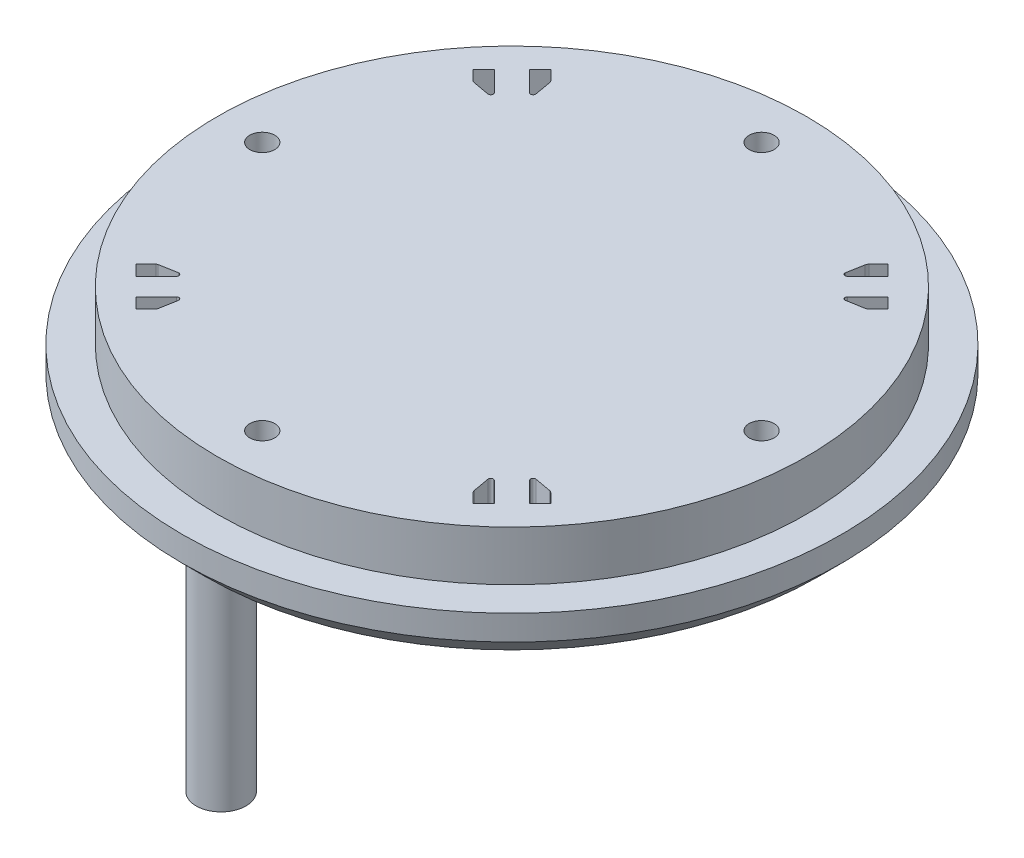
ISO-10303-21;
HEADER;
FILE_DESCRIPTION(('STEP AP214'),'2;1');
FILE_NAME('part.step','',(''),(''),'','','');
FILE_SCHEMA(('AUTOMOTIVE_DESIGN { 1 0 10303 214 1 1 1 1 }'));
ENDSEC;
DATA;
#1=APPLICATION_CONTEXT('core data for automotive mechanical design processes');
#2=APPLICATION_PROTOCOL_DEFINITION('international standard','automotive_design',2000,#1);
#3=PRODUCT_CONTEXT('',#1,'mechanical');
#4=PRODUCT('Part','Part','',(#3));
#5=PRODUCT_RELATED_PRODUCT_CATEGORY('part','',(#4));
#6=PRODUCT_DEFINITION_FORMATION('','',#4);
#7=PRODUCT_DEFINITION_CONTEXT('part definition',#1,'design');
#8=PRODUCT_DEFINITION('design','',#6,#7);
#9=PRODUCT_DEFINITION_SHAPE('','',#8);
#10=(LENGTH_UNIT() NAMED_UNIT(*) SI_UNIT(.MILLI.,.METRE.));
#11=(NAMED_UNIT(*) PLANE_ANGLE_UNIT() SI_UNIT($,.RADIAN.));
#12=(NAMED_UNIT(*) SI_UNIT($,.STERADIAN.) SOLID_ANGLE_UNIT());
#13=UNCERTAINTY_MEASURE_WITH_UNIT(LENGTH_MEASURE(1.E-05),#10,'distance_accuracy_value','');
#14=(GEOMETRIC_REPRESENTATION_CONTEXT(3) GLOBAL_UNCERTAINTY_ASSIGNED_CONTEXT((#13)) GLOBAL_UNIT_ASSIGNED_CONTEXT((#10,
#11,#12)) REPRESENTATION_CONTEXT('',''));
#15=CARTESIAN_POINT('',(0.,0.,0.));
#16=DIRECTION('',(0.,0.,1.));
#17=DIRECTION('',(1.,0.,0.));
#18=AXIS2_PLACEMENT_3D('',#15,#16,#17);
#19=CARTESIAN_POINT('',(0.,5.,0.));
#20=DIRECTION('',(0.,-1.,0.));
#21=DIRECTION('',(0.,0.,-1.));
#22=AXIS2_PLACEMENT_3D('',#19,#20,#21);
#23=CYLINDRICAL_SURFACE('',#22,33.);
#24=CARTESIAN_POINT('',(0.,2.50000000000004,0.));
#25=DIRECTION('',(0.,1.,0.));
#26=DIRECTION('',(0.,0.,1.));
#27=AXIS2_PLACEMENT_3D('',#24,#25,#26);
#28=CIRCLE('',#27,33.);
#29=CARTESIAN_POINT('',(0.,2.50000000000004,33.));
#30=VERTEX_POINT('',#29);
#31=EDGE_CURVE('E771',#30,#30,#28,.T.);
#32=ORIENTED_EDGE('',*,*,#31,.T.);
#33=EDGE_LOOP('',(#32));
#34=FACE_BOUND('',#33,.T.);
#35=CARTESIAN_POINT('',(0.,5.,0.));
#36=DIRECTION('',(0.,1.,0.));
#37=DIRECTION('',(0.,0.,1.));
#38=AXIS2_PLACEMENT_3D('',#35,#36,#37);
#39=CIRCLE('',#38,33.);
#40=CARTESIAN_POINT('',(0.,5.,33.));
#41=VERTEX_POINT('',#40);
#42=EDGE_CURVE('E767',#41,#41,#39,.T.);
#43=ORIENTED_EDGE('',*,*,#42,.F.);
#44=EDGE_LOOP('',(#43));
#45=FACE_BOUND('',#44,.T.);
#46=ADVANCED_FACE('F35',(#34,#45),#23,.T.);
#47=CARTESIAN_POINT('',(0.,5.,0.));
#48=DIRECTION('',(0.,1.,0.));
#49=DIRECTION('',(0.,0.,1.));
#50=AXIS2_PLACEMENT_3D('',#47,#48,#49);
#51=PLANE('',#50);
#52=CARTESIAN_POINT('',(0.,5.,0.));
#53=DIRECTION('',(0.,1.,0.));
#54=DIRECTION('',(0.,0.,1.));
#55=AXIS2_PLACEMENT_3D('',#52,#53,#54);
#56=CIRCLE('',#55,29.5);
#57=CARTESIAN_POINT('',(0.,5.,29.5));
#58=VERTEX_POINT('',#57);
#59=EDGE_CURVE('E768',#58,#58,#56,.T.);
#60=ORIENTED_EDGE('',*,*,#59,.F.);
#61=EDGE_LOOP('',(#60));
#62=FACE_BOUND('',#61,.T.);
#63=ORIENTED_EDGE('',*,*,#42,.T.);
#64=EDGE_LOOP('',(#63));
#65=FACE_BOUND('',#64,.T.);
#66=ADVANCED_FACE('F821',(#62,#65),#51,.T.);
#67=CARTESIAN_POINT('',(0.,10.,0.));
#68=DIRECTION('',(0.,-1.,0.));
#69=DIRECTION('',(0.,0.,-1.));
#70=AXIS2_PLACEMENT_3D('',#67,#68,#69);
#71=CYLINDRICAL_SURFACE('',#70,29.5);
#72=CARTESIAN_POINT('',(0.,10.,0.));
#73=DIRECTION('',(0.,1.,0.));
#74=DIRECTION('',(0.,0.,1.));
#75=AXIS2_PLACEMENT_3D('',#72,#73,#74);
#76=CIRCLE('',#75,29.5);
#77=CARTESIAN_POINT('',(0.,10.,29.5));
#78=VERTEX_POINT('',#77);
#79=EDGE_CURVE('E744',#78,#78,#76,.T.);
#80=ORIENTED_EDGE('',*,*,#79,.F.);
#81=EDGE_LOOP('',(#80));
#82=FACE_BOUND('',#81,.T.);
#83=ORIENTED_EDGE('',*,*,#59,.T.);
#84=EDGE_LOOP('',(#83));
#85=FACE_BOUND('',#84,.T.);
#86=ADVANCED_FACE('F827',(#82,#85),#71,.T.);
#87=CARTESIAN_POINT('',(0.,10.,0.));
#88=DIRECTION('',(0.,1.,0.));
#89=DIRECTION('',(0.,0.,1.));
#90=AXIS2_PLACEMENT_3D('',#87,#88,#89);
#91=PLANE('',#90);
#92=DIRECTION('',(0.707106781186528,0.,0.707106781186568));
#93=VECTOR('',#92,1.);
#94=CARTESIAN_POINT('',(-17.6888021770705,10.,-15.9210352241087));
#95=LINE('',#94,#93);
#96=CARTESIAN_POINT('',(-19.7120956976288,10.,-17.9443287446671));
#97=VERTEX_POINT('',#96);
#98=CARTESIAN_POINT('',(-17.6888021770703,10.,-15.9210352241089));
#99=VERTEX_POINT('',#98);
#100=EDGE_CURVE('E544',#97,#99,#95,.T.);
#101=ORIENTED_EDGE('',*,*,#100,.T.);
#102=CARTESIAN_POINT('',(-17.8655788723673,10.,-15.7442585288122));
#103=DIRECTION('',(0.,-1.,0.));
#104=DIRECTION('',(0.,0.,1.));
#105=AXIS2_PLACEMENT_3D('',#102,#103,#104);
#106=CIRCLE('',#105,0.250000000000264);
#107=CARTESIAN_POINT('',(-17.9099192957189,10.,-15.4982220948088));
#108=VERTEX_POINT('',#107);
#109=EDGE_CURVE('E547',#99,#108,#106,.T.);
#110=ORIENTED_EDGE('',*,*,#109,.T.);
#111=DIRECTION('',(-0.984145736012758,0.,-0.177361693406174));
#112=VECTOR('',#111,1.);
#113=CARTESIAN_POINT('',(-19.6350305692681,10.,-15.8091198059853));
#114=LINE('',#113,#112);
#115=CARTESIAN_POINT('',(-19.6350305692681,10.,-15.8091198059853));
#116=VERTEX_POINT('',#115);
#117=EDGE_CURVE('E50',#108,#116,#114,.T.);
#118=ORIENTED_EDGE('',*,*,#117,.T.);
#119=CARTESIAN_POINT('',(-19.5906901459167,10.,-16.0551562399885));
#120=DIRECTION('',(0.,-1.,0.));
#121=DIRECTION('',(0.,0.,1.));
#122=AXIS2_PLACEMENT_3D('',#119,#120,#121);
#123=CIRCLE('',#122,0.250000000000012);
#124=CARTESIAN_POINT('',(-19.7674668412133,10.,-15.8783795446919));
#125=VERTEX_POINT('',#124);
#126=EDGE_CURVE('E552',#116,#125,#123,.T.);
#127=ORIENTED_EDGE('',*,*,#126,.T.);
#128=DIRECTION('',(-0.707106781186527,0.,-0.707106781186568));
#129=VECTOR('',#128,1.);
#130=CARTESIAN_POINT('',(-20.7727558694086,10.,-16.8836685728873));
#131=LINE('',#130,#129);
#132=CARTESIAN_POINT('',(-20.7727558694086,10.,-16.8836685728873));
#133=VERTEX_POINT('',#132);
#134=EDGE_CURVE('E555',#125,#133,#131,.T.);
#135=ORIENTED_EDGE('',*,*,#134,.T.);
#136=DIRECTION('',(0.70710678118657,0.,-0.707106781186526));
#137=VECTOR('',#136,1.);
#138=CARTESIAN_POINT('',(-19.7120956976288,10.,-17.9443287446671));
#139=LINE('',#138,#137);
#140=EDGE_CURVE('E558',#133,#97,#139,.T.);
#141=ORIENTED_EDGE('',*,*,#140,.T.);
#142=EDGE_LOOP('',(#101,#110,#118,#127,#135,#141));
#143=FACE_BOUND('',#142,.T.);
#144=DIRECTION('',(0.707106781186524,0.,0.707106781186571));
#145=VECTOR('',#144,1.);
#146=CARTESIAN_POINT('',(19.7120956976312,10.,-17.9443287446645));
#147=LINE('',#146,#145);
#148=CARTESIAN_POINT('',(19.7120956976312,10.,-17.9443287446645));
#149=VERTEX_POINT('',#148);
#150=CARTESIAN_POINT('',(20.772755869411,10.,-16.8836685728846));
#151=VERTEX_POINT('',#150);
#152=EDGE_CURVE('E496',#149,#151,#147,.T.);
#153=ORIENTED_EDGE('',*,*,#152,.T.);
#154=DIRECTION('',(-0.707106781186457,0.,0.707106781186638));
#155=VECTOR('',#154,1.);
#156=CARTESIAN_POINT('',(20.772755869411,10.,-16.8836685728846));
#157=LINE('',#156,#155);
#158=CARTESIAN_POINT('',(19.8228379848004,10.,-15.9337506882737));
#159=VERTEX_POINT('',#158);
#160=EDGE_CURVE('E499',#151,#159,#157,.T.);
#161=ORIENTED_EDGE('',*,*,#160,.T.);
#162=CARTESIAN_POINT('',(19.4692845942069,10.,-16.2873040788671));
#163=DIRECTION('',(0.,-1.,0.));
#164=DIRECTION('',(0.,0.,-1.));
#165=AXIS2_PLACEMENT_3D('',#162,#163,#164);
#166=CIRCLE('',#165,0.500000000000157);
#167=CARTESIAN_POINT('',(19.5579654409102,10.,-15.7952312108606));
#168=VERTEX_POINT('',#167);
#169=EDGE_CURVE('E58',#159,#168,#166,.T.);
#170=ORIENTED_EDGE('',*,*,#169,.T.);
#171=DIRECTION('',(-0.98414573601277,0.,0.177361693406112));
#172=VECTOR('',#171,1.);
#173=CARTESIAN_POINT('',(19.5579654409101,10.,-15.7952312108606));
#174=LINE('',#173,#172);
#175=CARTESIAN_POINT('',(17.9099192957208,10.,-15.4982220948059));
#176=VERTEX_POINT('',#175);
#177=EDGE_CURVE('E504',#168,#176,#174,.T.);
#178=ORIENTED_EDGE('',*,*,#177,.T.);
#179=CARTESIAN_POINT('',(17.8655788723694,10.,-15.7442585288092));
#180=DIRECTION('',(0.,-1.,0.));
#181=DIRECTION('',(0.,0.,-1.));
#182=AXIS2_PLACEMENT_3D('',#179,#180,#181);
#183=CIRCLE('',#182,0.250000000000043);
#184=CARTESIAN_POINT('',(17.6888021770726,10.,-15.9210352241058));
#185=VERTEX_POINT('',#184);
#186=EDGE_CURVE('E507',#176,#185,#183,.T.);
#187=ORIENTED_EDGE('',*,*,#186,.T.);
#188=DIRECTION('',(0.707106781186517,0.,-0.707106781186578));
#189=VECTOR('',#188,1.);
#190=CARTESIAN_POINT('',(17.6888021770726,10.,-15.9210352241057));
#191=LINE('',#190,#189);
#192=EDGE_CURVE('E510',#185,#149,#191,.T.);
#193=ORIENTED_EDGE('',*,*,#192,.T.);
#194=EDGE_LOOP('',(#153,#161,#170,#178,#187,#193));
#195=FACE_BOUND('',#194,.T.);
#196=DIRECTION('',(-0.707106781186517,0.,0.707106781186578));
#197=VECTOR('',#196,1.);
#198=CARTESIAN_POINT('',(15.9210352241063,10.,-17.6888021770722));
#199=LINE('',#198,#197);
#200=CARTESIAN_POINT('',(17.9443287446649,10.,-19.7120956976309));
#201=VERTEX_POINT('',#200);
#202=CARTESIAN_POINT('',(15.9210352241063,10.,-17.6888021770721));
#203=VERTEX_POINT('',#202);
#204=EDGE_CURVE('E638',#201,#203,#199,.T.);
#205=ORIENTED_EDGE('',*,*,#204,.T.);
#206=CARTESIAN_POINT('',(15.7442585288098,10.,-17.865578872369));
#207=DIRECTION('',(0.,-1.,0.));
#208=DIRECTION('',(0.,0.,1.));
#209=AXIS2_PLACEMENT_3D('',#206,#207,#208);
#210=CIRCLE('',#209,0.250000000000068);
#211=CARTESIAN_POINT('',(15.4982220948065,10.,-17.9099192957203));
#212=VERTEX_POINT('',#211);
#213=EDGE_CURVE('E641',#203,#212,#210,.T.);
#214=ORIENTED_EDGE('',*,*,#213,.T.);
#215=DIRECTION('',(0.177361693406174,0.,-0.984145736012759));
#216=VECTOR('',#215,1.);
#217=CARTESIAN_POINT('',(15.7952312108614,10.,-19.5579654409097));
#218=LINE('',#217,#216);
#219=CARTESIAN_POINT('',(15.7952312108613,10.,-19.5579654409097));
#220=VERTEX_POINT('',#219);
#221=EDGE_CURVE('E645',#212,#220,#218,.T.);
#222=ORIENTED_EDGE('',*,*,#221,.T.);
#223=CARTESIAN_POINT('',(16.2873040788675,10.,-19.4692845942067));
#224=DIRECTION('',(0.,-1.,0.));
#225=DIRECTION('',(0.,0.,1.));
#226=AXIS2_PLACEMENT_3D('',#223,#224,#225);
#227=CIRCLE('',#226,0.499999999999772);
#228=CARTESIAN_POINT('',(15.9337506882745,10.,-19.8228379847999));
#229=VERTEX_POINT('',#228);
#230=EDGE_CURVE('E648',#220,#229,#227,.T.);
#231=ORIENTED_EDGE('',*,*,#230,.T.);
#232=DIRECTION('',(0.707106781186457,0.,-0.707106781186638));
#233=VECTOR('',#232,1.);
#234=CARTESIAN_POINT('',(16.8836685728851,10.,-20.7727558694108));
#235=LINE('',#234,#233);
#236=CARTESIAN_POINT('',(16.8836685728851,10.,-20.7727558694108));
#237=VERTEX_POINT('',#236);
#238=EDGE_CURVE('E651',#229,#237,#235,.T.);
#239=ORIENTED_EDGE('',*,*,#238,.T.);
#240=DIRECTION('',(0.707106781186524,0.,0.707106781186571));
#241=VECTOR('',#240,1.);
#242=CARTESIAN_POINT('',(17.9443287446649,10.,-19.7120956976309));
#243=LINE('',#242,#241);
#244=EDGE_CURVE('E654',#237,#201,#243,.T.);
#245=ORIENTED_EDGE('',*,*,#244,.T.);
#246=EDGE_LOOP('',(#205,#214,#222,#231,#239,#245));
#247=FACE_BOUND('',#246,.T.);
#248=DIRECTION('',(-0.707106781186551,0.,0.707106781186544));
#249=VECTOR('',#248,1.);
#250=CARTESIAN_POINT('',(17.9443287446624,10.,19.7120956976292));
#251=LINE('',#250,#249);
#252=CARTESIAN_POINT('',(17.9443287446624,10.,19.7120956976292));
#253=VERTEX_POINT('',#252);
#254=CARTESIAN_POINT('',(16.8836685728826,10.,20.772755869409));
#255=VERTEX_POINT('',#254);
#256=EDGE_CURVE('E588',#253,#255,#251,.T.);
#257=ORIENTED_EDGE('',*,*,#256,.T.);
#258=DIRECTION('',(-0.707106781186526,0.,-0.70710678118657));
#259=VECTOR('',#258,1.);
#260=CARTESIAN_POINT('',(16.8836685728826,10.,20.772755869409));
#261=LINE('',#260,#259);
#262=CARTESIAN_POINT('',(15.9337506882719,10.,19.8228379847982));
#263=VERTEX_POINT('',#262);
#264=EDGE_CURVE('E591',#255,#263,#261,.T.);
#265=ORIENTED_EDGE('',*,*,#264,.T.);
#266=CARTESIAN_POINT('',(16.2873040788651,10.,19.4692845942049));
#267=DIRECTION('',(0.,-1.,0.));
#268=DIRECTION('',(0.,0.,-1.));
#269=AXIS2_PLACEMENT_3D('',#266,#267,#268);
#270=CIRCLE('',#269,0.499999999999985);
#271=CARTESIAN_POINT('',(15.7952312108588,10.,19.557965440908));
#272=VERTEX_POINT('',#271);
#273=EDGE_CURVE('E595',#263,#272,#270,.T.);
#274=ORIENTED_EDGE('',*,*,#273,.T.);
#275=DIRECTION('',(-0.177361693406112,0.,-0.98414573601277));
#276=VECTOR('',#275,1.);
#277=CARTESIAN_POINT('',(15.7952312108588,10.,19.557965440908));
#278=LINE('',#277,#276);
#279=CARTESIAN_POINT('',(15.498222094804,10.,17.9099192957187));
#280=VERTEX_POINT('',#279);
#281=EDGE_CURVE('E598',#272,#280,#278,.T.);
#282=ORIENTED_EDGE('',*,*,#281,.T.);
#283=CARTESIAN_POINT('',(15.7442585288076,10.,17.8655788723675));
#284=DIRECTION('',(0.,-1.,0.));
#285=DIRECTION('',(0.,0.,-1.));
#286=AXIS2_PLACEMENT_3D('',#283,#284,#285);
#287=CIRCLE('',#286,0.250000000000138);
#288=CARTESIAN_POINT('',(15.9210352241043,10.,17.6888021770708));
#289=VERTEX_POINT('',#288);
#290=EDGE_CURVE('E601',#280,#289,#287,.T.);
#291=ORIENTED_EDGE('',*,*,#290,.T.);
#292=DIRECTION('',(0.707106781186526,0.,0.707106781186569));
#293=VECTOR('',#292,1.);
#294=CARTESIAN_POINT('',(15.9210352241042,10.,17.6888021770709));
#295=LINE('',#294,#293);
#296=EDGE_CURVE('E604',#289,#253,#295,.T.);
#297=ORIENTED_EDGE('',*,*,#296,.T.);
#298=EDGE_LOOP('',(#257,#265,#274,#282,#291,#297));
#299=FACE_BOUND('',#298,.T.);
#300=DIRECTION('',(-0.707106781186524,0.,-0.707106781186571));
#301=VECTOR('',#300,1.);
#302=CARTESIAN_POINT('',(-19.7120956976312,10.,17.9443287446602));
#303=LINE('',#302,#301);
#304=CARTESIAN_POINT('',(-19.7120956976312,10.,17.9443287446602));
#305=VERTEX_POINT('',#304);
#306=CARTESIAN_POINT('',(-20.772755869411,10.,16.8836685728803));
#307=VERTEX_POINT('',#306);
#308=EDGE_CURVE('E344',#305,#307,#303,.T.);
#309=ORIENTED_EDGE('',*,*,#308,.T.);
#310=DIRECTION('',(0.707106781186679,0.,-0.707106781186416));
#311=VECTOR('',#310,1.);
#312=CARTESIAN_POINT('',(-20.772755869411,10.,16.8836685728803));
#313=LINE('',#312,#311);
#314=CARTESIAN_POINT('',(-19.7674668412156,10.,15.8783795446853));
#315=VERTEX_POINT('',#314);
#316=EDGE_CURVE('E356',#307,#315,#313,.T.);
#317=ORIENTED_EDGE('',*,*,#316,.T.);
#318=CARTESIAN_POINT('',(-19.590690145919,10.,16.0551562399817));
#319=DIRECTION('',(0.,-1.,0.));
#320=DIRECTION('',(0.,0.,-1.));
#321=AXIS2_PLACEMENT_3D('',#318,#319,#320);
#322=CIRCLE('',#321,0.249999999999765);
#323=CARTESIAN_POINT('',(-19.6350305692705,10.,15.8091198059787));
#324=VERTEX_POINT('',#323);
#325=EDGE_CURVE('E360',#315,#324,#322,.T.);
#326=ORIENTED_EDGE('',*,*,#325,.T.);
#327=DIRECTION('',(0.98414573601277,0.,-0.177361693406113));
#328=VECTOR('',#327,1.);
#329=CARTESIAN_POINT('',(-19.6350305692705,10.,15.8091198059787));
#330=LINE('',#329,#328);
#331=CARTESIAN_POINT('',(-17.9099192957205,10.,15.4982220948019));
#332=VERTEX_POINT('',#331);
#333=EDGE_CURVE('E373',#324,#332,#330,.T.);
#334=ORIENTED_EDGE('',*,*,#333,.T.);
#335=CARTESIAN_POINT('',(-17.8655788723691,10.,15.7442585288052));
#336=DIRECTION('',(0.,-1.,0.));
#337=DIRECTION('',(0.,0.,-1.));
#338=AXIS2_PLACEMENT_3D('',#335,#336,#337);
#339=CIRCLE('',#338,0.25000000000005);
#340=CARTESIAN_POINT('',(-17.6888021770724,10.,15.9210352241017));
#341=VERTEX_POINT('',#340);
#342=EDGE_CURVE('E376',#332,#341,#339,.T.);
#343=ORIENTED_EDGE('',*,*,#342,.T.);
#344=DIRECTION('',(-0.707106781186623,0.,0.707106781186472));
#345=VECTOR('',#344,1.);
#346=CARTESIAN_POINT('',(-17.6888021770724,10.,15.9210352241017));
#347=LINE('',#346,#345);
#348=EDGE_CURVE('E352',#341,#305,#347,.T.);
#349=ORIENTED_EDGE('',*,*,#348,.T.);
#350=EDGE_LOOP('',(#309,#317,#326,#334,#343,#349));
#351=FACE_BOUND('',#350,.T.);
#352=DIRECTION('',(0.707106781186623,0.,-0.707106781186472));
#353=VECTOR('',#352,1.);
#354=CARTESIAN_POINT('',(-15.9210352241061,10.,17.6888021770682));
#355=LINE('',#354,#353);
#356=CARTESIAN_POINT('',(-17.9443287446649,10.,19.7120956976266));
#357=VERTEX_POINT('',#356);
#358=CARTESIAN_POINT('',(-15.9210352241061,10.,17.6888021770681));
#359=VERTEX_POINT('',#358);
#360=EDGE_CURVE('E450',#357,#359,#355,.T.);
#361=ORIENTED_EDGE('',*,*,#360,.T.);
#362=CARTESIAN_POINT('',(-15.7442585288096,10.,17.8655788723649));
#363=DIRECTION('',(0.,-1.,0.));
#364=DIRECTION('',(0.,0.,1.));
#365=AXIS2_PLACEMENT_3D('',#362,#363,#364);
#366=CIRCLE('',#365,0.250000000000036);
#367=CARTESIAN_POINT('',(-15.4982220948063,10.,17.9099192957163));
#368=VERTEX_POINT('',#367);
#369=EDGE_CURVE('E453',#359,#368,#366,.T.);
#370=ORIENTED_EDGE('',*,*,#369,.T.);
#371=DIRECTION('',(-0.177361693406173,0.,0.984145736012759));
#372=VECTOR('',#371,1.);
#373=CARTESIAN_POINT('',(-15.8091198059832,10.,19.6350305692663));
#374=LINE('',#373,#372);
#375=CARTESIAN_POINT('',(-15.8091198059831,10.,19.6350305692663));
#376=VERTEX_POINT('',#375);
#377=EDGE_CURVE('E457',#368,#376,#374,.T.);
#378=ORIENTED_EDGE('',*,*,#377,.T.);
#379=CARTESIAN_POINT('',(-16.0551562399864,10.,19.5906901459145));
#380=DIRECTION('',(0.,-1.,0.));
#381=DIRECTION('',(0.,0.,1.));
#382=AXIS2_PLACEMENT_3D('',#379,#380,#381);
#383=CIRCLE('',#382,0.250000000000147);
#384=CARTESIAN_POINT('',(-15.8783795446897,10.,19.7674668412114));
#385=VERTEX_POINT('',#384);
#386=EDGE_CURVE('E460',#376,#385,#383,.T.);
#387=ORIENTED_EDGE('',*,*,#386,.T.);
#388=DIRECTION('',(-0.707106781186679,0.,0.707106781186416));
#389=VECTOR('',#388,1.);
#390=CARTESIAN_POINT('',(-16.8836685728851,10.,20.7727558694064));
#391=LINE('',#390,#389);
#392=CARTESIAN_POINT('',(-16.8836685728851,10.,20.7727558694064));
#393=VERTEX_POINT('',#392);
#394=EDGE_CURVE('E463',#385,#393,#391,.T.);
#395=ORIENTED_EDGE('',*,*,#394,.T.);
#396=DIRECTION('',(-0.707106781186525,0.,-0.707106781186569));
#397=VECTOR('',#396,1.);
#398=CARTESIAN_POINT('',(-17.9443287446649,10.,19.7120956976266));
#399=LINE('',#398,#397);
#400=EDGE_CURVE('E466',#393,#357,#399,.T.);
#401=ORIENTED_EDGE('',*,*,#400,.T.);
#402=EDGE_LOOP('',(#361,#370,#378,#387,#395,#401));
#403=FACE_BOUND('',#402,.T.);
#404=DIRECTION('',(0.707106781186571,0.,-0.707106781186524));
#405=VECTOR('',#404,1.);
#406=CARTESIAN_POINT('',(-17.9443287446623,10.,-19.7120956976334));
#407=LINE('',#406,#405);
#408=CARTESIAN_POINT('',(-17.9443287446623,10.,-19.7120956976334));
#409=VERTEX_POINT('',#408);
#410=CARTESIAN_POINT('',(-16.8836685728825,10.,-20.7727558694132));
#411=VERTEX_POINT('',#410);
#412=EDGE_CURVE('E400',#409,#411,#407,.T.);
#413=ORIENTED_EDGE('',*,*,#412,.T.);
#414=DIRECTION('',(0.707106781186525,0.,0.707106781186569));
#415=VECTOR('',#414,1.);
#416=CARTESIAN_POINT('',(-16.8836685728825,10.,-20.7727558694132));
#417=LINE('',#416,#415);
#418=CARTESIAN_POINT('',(-15.8783795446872,10.,-19.7674668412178));
#419=VERTEX_POINT('',#418);
#420=EDGE_CURVE('E403',#411,#419,#417,.T.);
#421=ORIENTED_EDGE('',*,*,#420,.T.);
#422=CARTESIAN_POINT('',(-16.0551562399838,10.,-19.5906901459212));
#423=DIRECTION('',(0.,-1.,0.));
#424=DIRECTION('',(0.,0.,-1.));
#425=AXIS2_PLACEMENT_3D('',#422,#423,#424);
#426=CIRCLE('',#425,0.250000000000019);
#427=CARTESIAN_POINT('',(-15.8091198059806,10.,-19.6350305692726));
#428=VERTEX_POINT('',#427);
#429=EDGE_CURVE('E407',#419,#428,#426,.T.);
#430=ORIENTED_EDGE('',*,*,#429,.T.);
#431=DIRECTION('',(0.177361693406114,0.,0.984145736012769));
#432=VECTOR('',#431,1.);
#433=CARTESIAN_POINT('',(-15.8091198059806,10.,-19.6350305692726));
#434=LINE('',#433,#432);
#435=CARTESIAN_POINT('',(-15.4982220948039,10.,-17.9099192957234));
#436=VERTEX_POINT('',#435);
#437=EDGE_CURVE('E410',#428,#436,#434,.T.);
#438=ORIENTED_EDGE('',*,*,#437,.T.);
#439=CARTESIAN_POINT('',(-15.7442585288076,10.,-17.8655788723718));
#440=DIRECTION('',(0.,-1.,0.));
#441=DIRECTION('',(0.,0.,-1.));
#442=AXIS2_PLACEMENT_3D('',#439,#440,#441);
#443=CIRCLE('',#442,0.250000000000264);
#444=CARTESIAN_POINT('',(-15.9210352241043,10.,-17.6888021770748));
#445=VERTEX_POINT('',#444);
#446=EDGE_CURVE('E413',#436,#445,#443,.T.);
#447=ORIENTED_EDGE('',*,*,#446,.T.);
#448=DIRECTION('',(-0.707106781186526,0.,-0.707106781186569));
#449=VECTOR('',#448,1.);
#450=CARTESIAN_POINT('',(-15.9210352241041,10.,-17.688802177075));
#451=LINE('',#450,#449);
#452=EDGE_CURVE('E416',#445,#409,#451,.T.);
#453=ORIENTED_EDGE('',*,*,#452,.T.);
#454=EDGE_LOOP('',(#413,#421,#430,#438,#447,#453));
#455=FACE_BOUND('',#454,.T.);
#456=DIRECTION('',(-0.707106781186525,0.,-0.70710678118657));
#457=VECTOR('',#456,1.);
#458=CARTESIAN_POINT('',(17.6888021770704,10.,15.9210352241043));
#459=LINE('',#458,#457);
#460=CARTESIAN_POINT('',(19.712095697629,10.,17.944328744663));
#461=VERTEX_POINT('',#460);
#462=CARTESIAN_POINT('',(17.6888021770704,10.,15.9210352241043));
#463=VERTEX_POINT('',#462);
#464=EDGE_CURVE('E684',#461,#463,#459,.T.);
#465=ORIENTED_EDGE('',*,*,#464,.T.);
#466=CARTESIAN_POINT('',(17.865578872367,10.,15.7442585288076));
#467=DIRECTION('',(0.,-1.,0.));
#468=DIRECTION('',(0.,0.,1.));
#469=AXIS2_PLACEMENT_3D('',#466,#467,#468);
#470=CIRCLE('',#469,0.250000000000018);
#471=CARTESIAN_POINT('',(17.9099192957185,10.,15.4982220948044));
#472=VERTEX_POINT('',#471);
#473=EDGE_CURVE('E687',#463,#472,#470,.T.);
#474=ORIENTED_EDGE('',*,*,#473,.T.);
#475=DIRECTION('',(0.984145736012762,0.,0.177361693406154));
#476=VECTOR('',#475,1.);
#477=CARTESIAN_POINT('',(19.5579654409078,10.,15.7952312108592));
#478=LINE('',#477,#476);
#479=CARTESIAN_POINT('',(19.5579654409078,10.,15.7952312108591));
#480=VERTEX_POINT('',#479);
#481=EDGE_CURVE('E691',#472,#480,#478,.T.);
#482=ORIENTED_EDGE('',*,*,#481,.T.);
#483=CARTESIAN_POINT('',(19.4692845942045,10.,16.2873040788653));
#484=DIRECTION('',(0.,-1.,0.));
#485=DIRECTION('',(0.,0.,1.));
#486=AXIS2_PLACEMENT_3D('',#483,#484,#485);
#487=CIRCLE('',#486,0.499999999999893);
#488=CARTESIAN_POINT('',(19.8228379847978,10.,15.9337506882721));
#489=VERTEX_POINT('',#488);
#490=EDGE_CURVE('E694',#480,#489,#487,.T.);
#491=ORIENTED_EDGE('',*,*,#490,.T.);
#492=DIRECTION('',(0.707106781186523,0.,0.707106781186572));
#493=VECTOR('',#492,1.);
#494=CARTESIAN_POINT('',(20.7727558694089,10.,16.8836685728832));
#495=LINE('',#494,#493);
#496=CARTESIAN_POINT('',(20.7727558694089,10.,16.8836685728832));
#497=VERTEX_POINT('',#496);
#498=EDGE_CURVE('E697',#489,#497,#495,.T.);
#499=ORIENTED_EDGE('',*,*,#498,.T.);
#500=DIRECTION('',(-0.707106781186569,0.,0.707106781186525));
#501=VECTOR('',#500,1.);
#502=CARTESIAN_POINT('',(19.712095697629,10.,17.944328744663));
#503=LINE('',#502,#501);
#504=EDGE_CURVE('E700',#497,#461,#503,.T.);
#505=ORIENTED_EDGE('',*,*,#504,.T.);
#506=EDGE_LOOP('',(#465,#474,#482,#491,#499,#505));
#507=FACE_BOUND('',#506,.T.);
#508=CARTESIAN_POINT('',(0.,10.,25.));
#509=DIRECTION('',(0.,-1.,0.));
#510=DIRECTION('',(0.,0.,-1.));
#511=AXIS2_PLACEMENT_3D('',#508,#509,#510);
#512=CIRCLE('',#511,1.25);
#513=CARTESIAN_POINT('',(0.,10.,23.75));
#514=VERTEX_POINT('',#513);
#515=EDGE_CURVE('E741',#514,#514,#512,.T.);
#516=ORIENTED_EDGE('',*,*,#515,.T.);
#517=EDGE_LOOP('',(#516));
#518=FACE_BOUND('',#517,.T.);
#519=CARTESIAN_POINT('',(25.0000000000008,10.,7.76392260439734E-13));
#520=DIRECTION('',(0.,-1.,0.));
#521=DIRECTION('',(0.,0.,-1.));
#522=AXIS2_PLACEMENT_3D('',#519,#520,#521);
#523=CIRCLE('',#522,1.25);
#524=CARTESIAN_POINT('',(25.0000000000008,10.,-1.24999999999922));
#525=VERTEX_POINT('',#524);
#526=EDGE_CURVE('E748',#525,#525,#523,.T.);
#527=ORIENTED_EDGE('',*,*,#526,.T.);
#528=EDGE_LOOP('',(#527));
#529=FACE_BOUND('',#528,.T.);
#530=CARTESIAN_POINT('',(1.55278452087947E-12,10.,-25.));
#531=DIRECTION('',(0.,-1.,0.));
#532=DIRECTION('',(0.,0.,-1.));
#533=AXIS2_PLACEMENT_3D('',#530,#531,#532);
#534=CIRCLE('',#533,1.25);
#535=CARTESIAN_POINT('',(1.55278452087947E-12,10.,-26.25));
#536=VERTEX_POINT('',#535);
#537=EDGE_CURVE('E754',#536,#536,#534,.T.);
#538=ORIENTED_EDGE('',*,*,#537,.T.);
#539=EDGE_LOOP('',(#538));
#540=FACE_BOUND('',#539,.T.);
#541=CARTESIAN_POINT('',(-24.9999999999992,10.,-7.79453877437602E-13));
#542=DIRECTION('',(0.,-1.,0.));
#543=DIRECTION('',(0.,0.,-1.));
#544=AXIS2_PLACEMENT_3D('',#541,#542,#543);
#545=CIRCLE('',#544,1.25);
#546=CARTESIAN_POINT('',(-24.9999999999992,10.,-1.25000000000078));
#547=VERTEX_POINT('',#546);
#548=EDGE_CURVE('E760',#547,#547,#545,.T.);
#549=ORIENTED_EDGE('',*,*,#548,.T.);
#550=EDGE_LOOP('',(#549));
#551=FACE_BOUND('',#550,.T.);
#552=ORIENTED_EDGE('',*,*,#79,.T.);
#553=EDGE_LOOP('',(#552));
#554=FACE_BOUND('',#553,.T.);
#555=ADVANCED_FACE('F362',(#143,#195,#247,#299,#351,#403,#455,#507,#518,#529,#540,#551,#554),
#91,.T.);
#556=CARTESIAN_POINT('',(0.,0.,0.));
#557=DIRECTION('',(0.,-1.,0.));
#558=DIRECTION('',(0.,0.,-1.));
#559=AXIS2_PLACEMENT_3D('',#556,#557,#558);
#560=CONICAL_SURFACE('',#559,30.75,0.261799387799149);
#561=CARTESIAN_POINT('',(0.,2.75881904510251,0.));
#562=DIRECTION('',(0.,1.,0.));
#563=DIRECTION('',(0.,0.,1.));
#564=AXIS2_PLACEMENT_3D('',#561,#562,#563);
#565=CIRCLE('',#564,30.0107766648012);
#566=CARTESIAN_POINT('',(0.,2.75881904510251,30.0107766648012));
#567=VERTEX_POINT('',#566);
#568=EDGE_CURVE('E43',#567,#567,#565,.T.);
#569=ORIENTED_EDGE('',*,*,#568,.T.);
#570=EDGE_LOOP('',(#569));
#571=FACE_BOUND('',#570,.T.);
#572=CARTESIAN_POINT('',(0.,0.197168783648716,0.));
#573=DIRECTION('',(0.,-1.,0.));
#574=DIRECTION('',(0.,0.,-1.));
#575=AXIS2_PLACEMENT_3D('',#572,#573,#574);
#576=CIRCLE('',#575,30.6971687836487);
#577=CARTESIAN_POINT('',(0.,0.197168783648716,-30.6971687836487));
#578=VERTEX_POINT('',#577);
#579=EDGE_CURVE('E776',#578,#578,#576,.T.);
#580=ORIENTED_EDGE('',*,*,#579,.T.);
#581=EDGE_LOOP('',(#580));
#582=FACE_BOUND('',#581,.T.);
#583=ADVANCED_FACE('F784',(#571,#582),#560,.F.);
#584=CARTESIAN_POINT('',(0.,3.5,0.));
#585=DIRECTION('',(0.,-1.,0.));
#586=DIRECTION('',(0.,0.,-1.));
#587=AXIS2_PLACEMENT_3D('',#584,#585,#586);
#588=PLANE('',#587);
#589=DIRECTION('',(0.707106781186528,0.,0.707106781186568));
#590=VECTOR('',#589,1.);
#591=CARTESIAN_POINT('',(-17.6888021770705,3.5,-15.9210352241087));
#592=LINE('',#591,#590);
#593=CARTESIAN_POINT('',(-19.7120956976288,3.5,-17.9443287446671));
#594=VERTEX_POINT('',#593);
#595=CARTESIAN_POINT('',(-17.6888021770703,3.5,-15.9210352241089));
#596=VERTEX_POINT('',#595);
#597=EDGE_CURVE('E439',#594,#596,#592,.T.);
#598=ORIENTED_EDGE('',*,*,#597,.F.);
#599=DIRECTION('',(0.70710678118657,0.,-0.707106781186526));
#600=VECTOR('',#599,1.);
#601=CARTESIAN_POINT('',(-19.7120956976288,3.5,-17.9443287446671));
#602=LINE('',#601,#600);
#603=CARTESIAN_POINT('',(-20.7727558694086,3.5,-16.8836685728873));
#604=VERTEX_POINT('',#603);
#605=EDGE_CURVE('E548',#604,#594,#602,.T.);
#606=ORIENTED_EDGE('',*,*,#605,.F.);
#607=DIRECTION('',(-0.707106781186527,0.,-0.707106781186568));
#608=VECTOR('',#607,1.);
#609=CARTESIAN_POINT('',(-20.7727558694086,3.5,-16.8836685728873));
#610=LINE('',#609,#608);
#611=CARTESIAN_POINT('',(-19.7674668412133,3.5,-15.8783795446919));
#612=VERTEX_POINT('',#611);
#613=EDGE_CURVE('E572',#612,#604,#610,.T.);
#614=ORIENTED_EDGE('',*,*,#613,.F.);
#615=CARTESIAN_POINT('',(-19.5906901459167,3.5,-16.0551562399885));
#616=DIRECTION('',(0.,-1.,0.));
#617=DIRECTION('',(0.,0.,1.));
#618=AXIS2_PLACEMENT_3D('',#615,#616,#617);
#619=CIRCLE('',#618,0.250000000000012);
#620=CARTESIAN_POINT('',(-19.6350305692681,3.5,-15.8091198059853));
#621=VERTEX_POINT('',#620);
#622=EDGE_CURVE('E569',#621,#612,#619,.T.);
#623=ORIENTED_EDGE('',*,*,#622,.F.);
#624=DIRECTION('',(-0.984145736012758,0.,-0.177361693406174));
#625=VECTOR('',#624,1.);
#626=CARTESIAN_POINT('',(-19.6350305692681,3.5,-15.8091198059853));
#627=LINE('',#626,#625);
#628=CARTESIAN_POINT('',(-17.9099192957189,3.5,-15.4982220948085));
#629=VERTEX_POINT('',#628);
#630=EDGE_CURVE('E566',#629,#621,#627,.T.);
#631=ORIENTED_EDGE('',*,*,#630,.F.);
#632=CARTESIAN_POINT('',(-17.8655788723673,3.5,-15.7442585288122));
#633=DIRECTION('',(0.,-1.,0.));
#634=DIRECTION('',(0.,0.,1.));
#635=AXIS2_PLACEMENT_3D('',#632,#633,#634);
#636=CIRCLE('',#635,0.250000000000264);
#637=EDGE_CURVE('E563',#596,#629,#636,.T.);
#638=ORIENTED_EDGE('',*,*,#637,.F.);
#639=EDGE_LOOP('',(#598,#606,#614,#623,#631,#638));
#640=FACE_BOUND('',#639,.T.);
#641=DIRECTION('',(0.707106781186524,0.,0.707106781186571));
#642=VECTOR('',#641,1.);
#643=CARTESIAN_POINT('',(19.7120956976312,3.5,-17.9443287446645));
#644=LINE('',#643,#642);
#645=CARTESIAN_POINT('',(19.7120956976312,3.5,-17.9443287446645));
#646=VERTEX_POINT('',#645);
#647=CARTESIAN_POINT('',(20.772755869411,3.5,-16.8836685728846));
#648=VERTEX_POINT('',#647);
#649=EDGE_CURVE('E514',#646,#648,#644,.T.);
#650=ORIENTED_EDGE('',*,*,#649,.F.);
#651=DIRECTION('',(0.707106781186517,0.,-0.707106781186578));
#652=VECTOR('',#651,1.);
#653=CARTESIAN_POINT('',(17.6888021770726,3.5,-15.9210352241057));
#654=LINE('',#653,#652);
#655=CARTESIAN_POINT('',(17.6888021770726,3.5,-15.9210352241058));
#656=VERTEX_POINT('',#655);
#657=EDGE_CURVE('E500',#656,#646,#654,.T.);
#658=ORIENTED_EDGE('',*,*,#657,.F.);
#659=CARTESIAN_POINT('',(17.8655788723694,3.5,-15.7442585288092));
#660=DIRECTION('',(0.,-1.,0.));
#661=DIRECTION('',(0.,0.,-1.));
#662=AXIS2_PLACEMENT_3D('',#659,#660,#661);
#663=CIRCLE('',#662,0.250000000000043);
#664=CARTESIAN_POINT('',(17.9099192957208,3.5,-15.4982220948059));
#665=VERTEX_POINT('',#664);
#666=EDGE_CURVE('E526',#665,#656,#663,.T.);
#667=ORIENTED_EDGE('',*,*,#666,.F.);
#668=DIRECTION('',(-0.98414573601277,0.,0.177361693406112));
#669=VECTOR('',#668,1.);
#670=CARTESIAN_POINT('',(19.5579654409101,3.5,-15.7952312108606));
#671=LINE('',#670,#669);
#672=CARTESIAN_POINT('',(19.5579654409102,3.5,-15.7952312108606));
#673=VERTEX_POINT('',#672);
#674=EDGE_CURVE('E523',#673,#665,#671,.T.);
#675=ORIENTED_EDGE('',*,*,#674,.F.);
#676=CARTESIAN_POINT('',(19.4692845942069,3.5,-16.2873040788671));
#677=DIRECTION('',(0.,-1.,0.));
#678=DIRECTION('',(0.,0.,-1.));
#679=AXIS2_PLACEMENT_3D('',#676,#677,#678);
#680=CIRCLE('',#679,0.500000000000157);
#681=CARTESIAN_POINT('',(19.8228379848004,3.5,-15.9337506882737));
#682=VERTEX_POINT('',#681);
#683=EDGE_CURVE('E520',#682,#673,#680,.T.);
#684=ORIENTED_EDGE('',*,*,#683,.F.);
#685=DIRECTION('',(-0.707106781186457,0.,0.707106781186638));
#686=VECTOR('',#685,1.);
#687=CARTESIAN_POINT('',(20.772755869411,3.5,-16.8836685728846));
#688=LINE('',#687,#686);
#689=EDGE_CURVE('E516',#648,#682,#688,.T.);
#690=ORIENTED_EDGE('',*,*,#689,.F.);
#691=EDGE_LOOP('',(#650,#658,#667,#675,#684,#690));
#692=FACE_BOUND('',#691,.T.);
#693=DIRECTION('',(-0.707106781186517,0.,0.707106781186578));
#694=VECTOR('',#693,1.);
#695=CARTESIAN_POINT('',(15.9210352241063,3.5,-17.6888021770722));
#696=LINE('',#695,#694);
#697=CARTESIAN_POINT('',(17.9443287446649,3.5,-19.7120956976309));
#698=VERTEX_POINT('',#697);
#699=CARTESIAN_POINT('',(15.9210352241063,3.5,-17.6888021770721));
#700=VERTEX_POINT('',#699);
#701=EDGE_CURVE('E533',#698,#700,#696,.T.);
#702=ORIENTED_EDGE('',*,*,#701,.F.);
#703=DIRECTION('',(0.707106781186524,0.,0.707106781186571));
#704=VECTOR('',#703,1.);
#705=CARTESIAN_POINT('',(17.9443287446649,3.5,-19.7120956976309));
#706=LINE('',#705,#704);
#707=CARTESIAN_POINT('',(16.8836685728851,3.5,-20.7727558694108));
#708=VERTEX_POINT('',#707);
#709=EDGE_CURVE('E642',#708,#698,#706,.T.);
#710=ORIENTED_EDGE('',*,*,#709,.F.);
#711=DIRECTION('',(0.707106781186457,0.,-0.707106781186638));
#712=VECTOR('',#711,1.);
#713=CARTESIAN_POINT('',(16.8836685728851,3.5,-20.7727558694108));
#714=LINE('',#713,#712);
#715=CARTESIAN_POINT('',(15.9337506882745,3.5,-19.8228379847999));
#716=VERTEX_POINT('',#715);
#717=EDGE_CURVE('E668',#716,#708,#714,.T.);
#718=ORIENTED_EDGE('',*,*,#717,.F.);
#719=CARTESIAN_POINT('',(16.2873040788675,3.5,-19.4692845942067));
#720=DIRECTION('',(0.,-1.,0.));
#721=DIRECTION('',(0.,0.,1.));
#722=AXIS2_PLACEMENT_3D('',#719,#720,#721);
#723=CIRCLE('',#722,0.499999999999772);
#724=CARTESIAN_POINT('',(15.7952312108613,3.5,-19.5579654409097));
#725=VERTEX_POINT('',#724);
#726=EDGE_CURVE('E665',#725,#716,#723,.T.);
#727=ORIENTED_EDGE('',*,*,#726,.F.);
#728=DIRECTION('',(0.177361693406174,0.,-0.984145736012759));
#729=VECTOR('',#728,1.);
#730=CARTESIAN_POINT('',(15.7952312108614,3.5,-19.5579654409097));
#731=LINE('',#730,#729);
#732=CARTESIAN_POINT('',(15.4982220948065,3.5,-17.9099192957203));
#733=VERTEX_POINT('',#732);
#734=EDGE_CURVE('E662',#733,#725,#731,.T.);
#735=ORIENTED_EDGE('',*,*,#734,.F.);
#736=CARTESIAN_POINT('',(15.7442585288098,3.5,-17.865578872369));
#737=DIRECTION('',(0.,-1.,0.));
#738=DIRECTION('',(0.,0.,1.));
#739=AXIS2_PLACEMENT_3D('',#736,#737,#738);
#740=CIRCLE('',#739,0.250000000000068);
#741=EDGE_CURVE('E659',#700,#733,#740,.T.);
#742=ORIENTED_EDGE('',*,*,#741,.F.);
#743=EDGE_LOOP('',(#702,#710,#718,#727,#735,#742));
#744=FACE_BOUND('',#743,.T.);
#745=DIRECTION('',(-0.707106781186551,0.,0.707106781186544));
#746=VECTOR('',#745,1.);
#747=CARTESIAN_POINT('',(17.9443287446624,3.5,19.7120956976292));
#748=LINE('',#747,#746);
#749=CARTESIAN_POINT('',(17.9443287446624,3.5,19.7120956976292));
#750=VERTEX_POINT('',#749);
#751=CARTESIAN_POINT('',(16.8836685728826,3.5,20.772755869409));
#752=VERTEX_POINT('',#751);
#753=EDGE_CURVE('E608',#750,#752,#748,.T.);
#754=ORIENTED_EDGE('',*,*,#753,.F.);
#755=DIRECTION('',(0.707106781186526,0.,0.707106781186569));
#756=VECTOR('',#755,1.);
#757=CARTESIAN_POINT('',(15.9210352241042,3.5,17.6888021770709));
#758=LINE('',#757,#756);
#759=CARTESIAN_POINT('',(15.9210352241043,3.5,17.6888021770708));
#760=VERTEX_POINT('',#759);
#761=EDGE_CURVE('E592',#760,#750,#758,.T.);
#762=ORIENTED_EDGE('',*,*,#761,.F.);
#763=CARTESIAN_POINT('',(15.7442585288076,3.5,17.8655788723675));
#764=DIRECTION('',(0.,-1.,0.));
#765=DIRECTION('',(0.,0.,-1.));
#766=AXIS2_PLACEMENT_3D('',#763,#764,#765);
#767=CIRCLE('',#766,0.250000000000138);
#768=CARTESIAN_POINT('',(15.498222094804,3.5,17.9099192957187));
#769=VERTEX_POINT('',#768);
#770=EDGE_CURVE('E620',#769,#760,#767,.T.);
#771=ORIENTED_EDGE('',*,*,#770,.F.);
#772=DIRECTION('',(-0.177361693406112,0.,-0.98414573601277));
#773=VECTOR('',#772,1.);
#774=CARTESIAN_POINT('',(15.7952312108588,3.5,19.557965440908));
#775=LINE('',#774,#773);
#776=CARTESIAN_POINT('',(15.7952312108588,3.5,19.557965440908));
#777=VERTEX_POINT('',#776);
#778=EDGE_CURVE('E617',#777,#769,#775,.T.);
#779=ORIENTED_EDGE('',*,*,#778,.F.);
#780=CARTESIAN_POINT('',(16.2873040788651,3.5,19.4692845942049));
#781=DIRECTION('',(0.,-1.,0.));
#782=DIRECTION('',(0.,0.,-1.));
#783=AXIS2_PLACEMENT_3D('',#780,#781,#782);
#784=CIRCLE('',#783,0.499999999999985);
#785=CARTESIAN_POINT('',(15.9337506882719,3.5,19.8228379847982));
#786=VERTEX_POINT('',#785);
#787=EDGE_CURVE('E614',#786,#777,#784,.T.);
#788=ORIENTED_EDGE('',*,*,#787,.F.);
#789=DIRECTION('',(-0.707106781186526,0.,-0.70710678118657));
#790=VECTOR('',#789,1.);
#791=CARTESIAN_POINT('',(16.8836685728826,3.5,20.772755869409));
#792=LINE('',#791,#790);
#793=EDGE_CURVE('E610',#752,#786,#792,.T.);
#794=ORIENTED_EDGE('',*,*,#793,.F.);
#795=EDGE_LOOP('',(#754,#762,#771,#779,#788,#794));
#796=FACE_BOUND('',#795,.T.);
#797=DIRECTION('',(-0.707106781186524,0.,-0.707106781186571));
#798=VECTOR('',#797,1.);
#799=CARTESIAN_POINT('',(-19.7120956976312,3.5,17.9443287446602));
#800=LINE('',#799,#798);
#801=CARTESIAN_POINT('',(-19.7120956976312,3.5,17.9443287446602));
#802=VERTEX_POINT('',#801);
#803=CARTESIAN_POINT('',(-20.772755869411,3.5,16.8836685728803));
#804=VERTEX_POINT('',#803);
#805=EDGE_CURVE('E347',#802,#804,#800,.T.);
#806=ORIENTED_EDGE('',*,*,#805,.F.);
#807=DIRECTION('',(-0.707106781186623,0.,0.707106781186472));
#808=VECTOR('',#807,1.);
#809=CARTESIAN_POINT('',(-17.6888021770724,3.5,15.9210352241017));
#810=LINE('',#809,#808);
#811=CARTESIAN_POINT('',(-17.6888021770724,3.5,15.9210352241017));
#812=VERTEX_POINT('',#811);
#813=EDGE_CURVE('E366',#812,#802,#810,.T.);
#814=ORIENTED_EDGE('',*,*,#813,.F.);
#815=CARTESIAN_POINT('',(-17.8655788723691,3.5,15.7442585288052));
#816=DIRECTION('',(0.,-1.,0.));
#817=DIRECTION('',(0.,0.,-1.));
#818=AXIS2_PLACEMENT_3D('',#815,#816,#817);
#819=CIRCLE('',#818,0.25000000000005);
#820=CARTESIAN_POINT('',(-17.9099192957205,3.5,15.4982220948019));
#821=VERTEX_POINT('',#820);
#822=EDGE_CURVE('E369',#821,#812,#819,.T.);
#823=ORIENTED_EDGE('',*,*,#822,.F.);
#824=DIRECTION('',(0.98414573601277,0.,-0.177361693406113));
#825=VECTOR('',#824,1.);
#826=CARTESIAN_POINT('',(-19.6350305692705,3.5,15.8091198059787));
#827=LINE('',#826,#825);
#828=CARTESIAN_POINT('',(-19.6350305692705,3.5,15.8091198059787));
#829=VERTEX_POINT('',#828);
#830=EDGE_CURVE('E385',#829,#821,#827,.T.);
#831=ORIENTED_EDGE('',*,*,#830,.F.);
#832=CARTESIAN_POINT('',(-19.590690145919,3.5,16.0551562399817));
#833=DIRECTION('',(0.,-1.,0.));
#834=DIRECTION('',(0.,0.,-1.));
#835=AXIS2_PLACEMENT_3D('',#832,#833,#834);
#836=CIRCLE('',#835,0.249999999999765);
#837=CARTESIAN_POINT('',(-19.7674668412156,3.5,15.8783795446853));
#838=VERTEX_POINT('',#837);
#839=EDGE_CURVE('E382',#838,#829,#836,.T.);
#840=ORIENTED_EDGE('',*,*,#839,.F.);
#841=DIRECTION('',(0.707106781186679,0.,-0.707106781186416));
#842=VECTOR('',#841,1.);
#843=CARTESIAN_POINT('',(-20.772755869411,3.5,16.8836685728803));
#844=LINE('',#843,#842);
#845=EDGE_CURVE('E380',#804,#838,#844,.T.);
#846=ORIENTED_EDGE('',*,*,#845,.F.);
#847=EDGE_LOOP('',(#806,#814,#823,#831,#840,#846));
#848=FACE_BOUND('',#847,.T.);
#849=DIRECTION('',(0.707106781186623,0.,-0.707106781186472));
#850=VECTOR('',#849,1.);
#851=CARTESIAN_POINT('',(-15.9210352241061,3.5,17.6888021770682));
#852=LINE('',#851,#850);
#853=CARTESIAN_POINT('',(-17.9443287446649,3.5,19.7120956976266));
#854=VERTEX_POINT('',#853);
#855=CARTESIAN_POINT('',(-15.9210352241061,3.5,17.6888021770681));
#856=VERTEX_POINT('',#855);
#857=EDGE_CURVE('E392',#854,#856,#852,.T.);
#858=ORIENTED_EDGE('',*,*,#857,.F.);
#859=DIRECTION('',(-0.707106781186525,0.,-0.707106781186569));
#860=VECTOR('',#859,1.);
#861=CARTESIAN_POINT('',(-17.9443287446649,3.5,19.7120956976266));
#862=LINE('',#861,#860);
#863=CARTESIAN_POINT('',(-16.8836685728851,3.5,20.7727558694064));
#864=VERTEX_POINT('',#863);
#865=EDGE_CURVE('E454',#864,#854,#862,.T.);
#866=ORIENTED_EDGE('',*,*,#865,.F.);
#867=DIRECTION('',(-0.707106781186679,0.,0.707106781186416));
#868=VECTOR('',#867,1.);
#869=CARTESIAN_POINT('',(-16.8836685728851,3.5,20.7727558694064));
#870=LINE('',#869,#868);
#871=CARTESIAN_POINT('',(-15.8783795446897,3.5,19.7674668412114));
#872=VERTEX_POINT('',#871);
#873=EDGE_CURVE('E480',#872,#864,#870,.T.);
#874=ORIENTED_EDGE('',*,*,#873,.F.);
#875=CARTESIAN_POINT('',(-16.0551562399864,3.5,19.5906901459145));
#876=DIRECTION('',(0.,-1.,0.));
#877=DIRECTION('',(0.,0.,1.));
#878=AXIS2_PLACEMENT_3D('',#875,#876,#877);
#879=CIRCLE('',#878,0.250000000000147);
#880=CARTESIAN_POINT('',(-15.8091198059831,3.5,19.6350305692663));
#881=VERTEX_POINT('',#880);
#882=EDGE_CURVE('E477',#881,#872,#879,.T.);
#883=ORIENTED_EDGE('',*,*,#882,.F.);
#884=DIRECTION('',(-0.177361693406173,0.,0.984145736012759));
#885=VECTOR('',#884,1.);
#886=CARTESIAN_POINT('',(-15.8091198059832,3.5,19.6350305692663));
#887=LINE('',#886,#885);
#888=CARTESIAN_POINT('',(-15.4982220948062,3.5,17.9099192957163));
#889=VERTEX_POINT('',#888);
#890=EDGE_CURVE('E474',#889,#881,#887,.T.);
#891=ORIENTED_EDGE('',*,*,#890,.F.);
#892=CARTESIAN_POINT('',(-15.7442585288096,3.5,17.8655788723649));
#893=DIRECTION('',(0.,-1.,0.));
#894=DIRECTION('',(0.,0.,1.));
#895=AXIS2_PLACEMENT_3D('',#892,#893,#894);
#896=CIRCLE('',#895,0.250000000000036);
#897=EDGE_CURVE('E471',#856,#889,#896,.T.);
#898=ORIENTED_EDGE('',*,*,#897,.F.);
#899=EDGE_LOOP('',(#858,#866,#874,#883,#891,#898));
#900=FACE_BOUND('',#899,.T.);
#901=DIRECTION('',(0.707106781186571,0.,-0.707106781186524));
#902=VECTOR('',#901,1.);
#903=CARTESIAN_POINT('',(-17.9443287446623,3.5,-19.7120956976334));
#904=LINE('',#903,#902);
#905=CARTESIAN_POINT('',(-17.9443287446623,3.5,-19.7120956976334));
#906=VERTEX_POINT('',#905);
#907=CARTESIAN_POINT('',(-16.8836685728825,3.5,-20.7727558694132));
#908=VERTEX_POINT('',#907);
#909=EDGE_CURVE('E420',#906,#908,#904,.T.);
#910=ORIENTED_EDGE('',*,*,#909,.F.);
#911=DIRECTION('',(-0.707106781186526,0.,-0.707106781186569));
#912=VECTOR('',#911,1.);
#913=CARTESIAN_POINT('',(-15.9210352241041,3.5,-17.688802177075));
#914=LINE('',#913,#912);
#915=CARTESIAN_POINT('',(-15.9210352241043,3.5,-17.6888021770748));
#916=VERTEX_POINT('',#915);
#917=EDGE_CURVE('E404',#916,#906,#914,.T.);
#918=ORIENTED_EDGE('',*,*,#917,.F.);
#919=CARTESIAN_POINT('',(-15.7442585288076,3.5,-17.8655788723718));
#920=DIRECTION('',(0.,-1.,0.));
#921=DIRECTION('',(0.,0.,-1.));
#922=AXIS2_PLACEMENT_3D('',#919,#920,#921);
#923=CIRCLE('',#922,0.250000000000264);
#924=CARTESIAN_POINT('',(-15.4982220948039,3.5,-17.9099192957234));
#925=VERTEX_POINT('',#924);
#926=EDGE_CURVE('E432',#925,#916,#923,.T.);
#927=ORIENTED_EDGE('',*,*,#926,.F.);
#928=DIRECTION('',(0.177361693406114,0.,0.984145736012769));
#929=VECTOR('',#928,1.);
#930=CARTESIAN_POINT('',(-15.8091198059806,3.5,-19.6350305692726));
#931=LINE('',#930,#929);
#932=CARTESIAN_POINT('',(-15.8091198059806,3.5,-19.6350305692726));
#933=VERTEX_POINT('',#932);
#934=EDGE_CURVE('E429',#933,#925,#931,.T.);
#935=ORIENTED_EDGE('',*,*,#934,.F.);
#936=CARTESIAN_POINT('',(-16.0551562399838,3.5,-19.5906901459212));
#937=DIRECTION('',(0.,-1.,0.));
#938=DIRECTION('',(0.,0.,-1.));
#939=AXIS2_PLACEMENT_3D('',#936,#937,#938);
#940=CIRCLE('',#939,0.250000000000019);
#941=CARTESIAN_POINT('',(-15.8783795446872,3.5,-19.7674668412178));
#942=VERTEX_POINT('',#941);
#943=EDGE_CURVE('E426',#942,#933,#940,.T.);
#944=ORIENTED_EDGE('',*,*,#943,.F.);
#945=DIRECTION('',(0.707106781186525,0.,0.707106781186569));
#946=VECTOR('',#945,1.);
#947=CARTESIAN_POINT('',(-16.8836685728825,3.5,-20.7727558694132));
#948=LINE('',#947,#946);
#949=EDGE_CURVE('E422',#908,#942,#948,.T.);
#950=ORIENTED_EDGE('',*,*,#949,.F.);
#951=EDGE_LOOP('',(#910,#918,#927,#935,#944,#950));
#952=FACE_BOUND('',#951,.T.);
#953=DIRECTION('',(-0.707106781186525,0.,-0.70710678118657));
#954=VECTOR('',#953,1.);
#955=CARTESIAN_POINT('',(17.6888021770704,3.5,15.9210352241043));
#956=LINE('',#955,#954);
#957=CARTESIAN_POINT('',(19.712095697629,3.5,17.944328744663));
#958=VERTEX_POINT('',#957);
#959=CARTESIAN_POINT('',(17.6888021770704,3.5,15.9210352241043));
#960=VERTEX_POINT('',#959);
#961=EDGE_CURVE('E627',#958,#960,#956,.T.);
#962=ORIENTED_EDGE('',*,*,#961,.F.);
#963=DIRECTION('',(-0.707106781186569,0.,0.707106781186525));
#964=VECTOR('',#963,1.);
#965=CARTESIAN_POINT('',(19.712095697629,3.5,17.944328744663));
#966=LINE('',#965,#964);
#967=CARTESIAN_POINT('',(20.7727558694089,3.5,16.8836685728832));
#968=VERTEX_POINT('',#967);
#969=EDGE_CURVE('E688',#968,#958,#966,.T.);
#970=ORIENTED_EDGE('',*,*,#969,.F.);
#971=DIRECTION('',(0.707106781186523,0.,0.707106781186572));
#972=VECTOR('',#971,1.);
#973=CARTESIAN_POINT('',(20.7727558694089,3.5,16.8836685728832));
#974=LINE('',#973,#972);
#975=CARTESIAN_POINT('',(19.8228379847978,3.5,15.9337506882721));
#976=VERTEX_POINT('',#975);
#977=EDGE_CURVE('E714',#976,#968,#974,.T.);
#978=ORIENTED_EDGE('',*,*,#977,.F.);
#979=CARTESIAN_POINT('',(19.4692845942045,3.5,16.2873040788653));
#980=DIRECTION('',(0.,-1.,0.));
#981=DIRECTION('',(0.,0.,1.));
#982=AXIS2_PLACEMENT_3D('',#979,#980,#981);
#983=CIRCLE('',#982,0.499999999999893);
#984=CARTESIAN_POINT('',(19.5579654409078,3.5,15.7952312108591));
#985=VERTEX_POINT('',#984);
#986=EDGE_CURVE('E711',#985,#976,#983,.T.);
#987=ORIENTED_EDGE('',*,*,#986,.F.);
#988=DIRECTION('',(0.984145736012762,0.,0.177361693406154));
#989=VECTOR('',#988,1.);
#990=CARTESIAN_POINT('',(19.5579654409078,3.5,15.7952312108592));
#991=LINE('',#990,#989);
#992=CARTESIAN_POINT('',(17.9099192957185,3.5,15.4982220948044));
#993=VERTEX_POINT('',#992);
#994=EDGE_CURVE('E708',#993,#985,#991,.T.);
#995=ORIENTED_EDGE('',*,*,#994,.F.);
#996=CARTESIAN_POINT('',(17.865578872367,3.5,15.7442585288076));
#997=DIRECTION('',(0.,-1.,0.));
#998=DIRECTION('',(0.,0.,1.));
#999=AXIS2_PLACEMENT_3D('',#996,#997,#998);
#1000=CIRCLE('',#999,0.250000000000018);
#1001=EDGE_CURVE('E705',#960,#993,#1000,.T.);
#1002=ORIENTED_EDGE('',*,*,#1001,.F.);
#1003=EDGE_LOOP('',(#962,#970,#978,#987,#995,#1002));
#1004=FACE_BOUND('',#1003,.T.);
#1005=CARTESIAN_POINT('',(-7.26876416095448,3.5,21.8511613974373));
#1006=DIRECTION('',(0.,-1.,0.));
#1007=DIRECTION('',(0.,0.,-1.));
#1008=AXIS2_PLACEMENT_3D('',#1005,#1006,#1007);
#1009=CIRCLE('',#1008,2.5);
#1010=CARTESIAN_POINT('',(-7.26876416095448,3.5,19.3511613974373));
#1011=VERTEX_POINT('',#1010);
#1012=EDGE_CURVE('E734',#1011,#1011,#1009,.T.);
#1013=ORIENTED_EDGE('',*,*,#1012,.F.);
#1014=EDGE_LOOP('',(#1013));
#1015=FACE_BOUND('',#1014,.T.);
#1016=CARTESIAN_POINT('',(0.,3.5,0.));
#1017=DIRECTION('',(0.,-1.,0.));
#1018=DIRECTION('',(0.,0.,-1.));
#1019=AXIS2_PLACEMENT_3D('',#1016,#1017,#1018);
#1020=CIRCLE('',#1019,29.0448508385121);
#1021=CARTESIAN_POINT('',(0.,3.5,-29.0448508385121));
#1022=VERTEX_POINT('',#1021);
#1023=EDGE_CURVE('E779',#1022,#1022,#1020,.T.);
#1024=ORIENTED_EDGE('',*,*,#1023,.T.);
#1025=EDGE_LOOP('',(#1024));
#1026=FACE_BOUND('',#1025,.T.);
#1027=CARTESIAN_POINT('',(0.,3.5,25.));
#1028=DIRECTION('',(0.,-1.,0.));
#1029=DIRECTION('',(0.,0.,-1.));
#1030=AXIS2_PLACEMENT_3D('',#1027,#1028,#1029);
#1031=CIRCLE('',#1030,1.25);
#1032=CARTESIAN_POINT('',(0.,3.5,23.75));
#1033=VERTEX_POINT('',#1032);
#1034=EDGE_CURVE('E745',#1033,#1033,#1031,.T.);
#1035=ORIENTED_EDGE('',*,*,#1034,.F.);
#1036=EDGE_LOOP('',(#1035));
#1037=FACE_BOUND('',#1036,.T.);
#1038=CARTESIAN_POINT('',(25.0000000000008,3.5,7.76392260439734E-13));
#1039=DIRECTION('',(0.,-1.,0.));
#1040=DIRECTION('',(0.,0.,-1.));
#1041=AXIS2_PLACEMENT_3D('',#1038,#1039,#1040);
#1042=CIRCLE('',#1041,1.25);
#1043=CARTESIAN_POINT('',(25.0000000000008,3.5,-1.24999999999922));
#1044=VERTEX_POINT('',#1043);
#1045=EDGE_CURVE('E751',#1044,#1044,#1042,.T.);
#1046=ORIENTED_EDGE('',*,*,#1045,.F.);
#1047=EDGE_LOOP('',(#1046));
#1048=FACE_BOUND('',#1047,.T.);
#1049=CARTESIAN_POINT('',(1.55278452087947E-12,3.5,-25.));
#1050=DIRECTION('',(0.,-1.,0.));
#1051=DIRECTION('',(0.,0.,-1.));
#1052=AXIS2_PLACEMENT_3D('',#1049,#1050,#1051);
#1053=CIRCLE('',#1052,1.25);
#1054=CARTESIAN_POINT('',(1.55278452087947E-12,3.5,-26.25));
#1055=VERTEX_POINT('',#1054);
#1056=EDGE_CURVE('E757',#1055,#1055,#1053,.T.);
#1057=ORIENTED_EDGE('',*,*,#1056,.F.);
#1058=EDGE_LOOP('',(#1057));
#1059=FACE_BOUND('',#1058,.T.);
#1060=CARTESIAN_POINT('',(-24.9999999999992,3.5,-7.79453877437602E-13));
#1061=DIRECTION('',(0.,-1.,0.));
#1062=DIRECTION('',(0.,0.,-1.));
#1063=AXIS2_PLACEMENT_3D('',#1060,#1061,#1062);
#1064=CIRCLE('',#1063,1.25);
#1065=CARTESIAN_POINT('',(-24.9999999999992,3.5,-1.25000000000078));
#1066=VERTEX_POINT('',#1065);
#1067=EDGE_CURVE('E738',#1066,#1066,#1064,.T.);
#1068=ORIENTED_EDGE('',*,*,#1067,.F.);
#1069=EDGE_LOOP('',(#1068));
#1070=FACE_BOUND('',#1069,.T.);
#1071=ADVANCED_FACE('F793',(#640,#692,#744,#796,#848,#900,#952,#1004,#1015,#1026,#1037,#1048,
#1059,#1070),#588,.T.);
#1072=CARTESIAN_POINT('',(-24.9999999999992,10.,-7.79453877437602E-13));
#1073=DIRECTION('',(0.,-1.,0.));
#1074=DIRECTION('',(0.,0.,-1.));
#1075=AXIS2_PLACEMENT_3D('',#1072,#1073,#1074);
#1076=CYLINDRICAL_SURFACE('',#1075,1.25);
#1077=ORIENTED_EDGE('',*,*,#548,.F.);
#1078=EDGE_LOOP('',(#1077));
#1079=FACE_BOUND('',#1078,.T.);
#1080=ORIENTED_EDGE('',*,*,#1067,.T.);
#1081=EDGE_LOOP('',(#1080));
#1082=FACE_BOUND('',#1081,.T.);
#1083=ADVANCED_FACE('F796',(#1079,#1082),#1076,.F.);
#1084=CARTESIAN_POINT('',(1.55278452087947E-12,10.,-25.));
#1085=DIRECTION('',(0.,-1.,0.));
#1086=DIRECTION('',(0.,0.,-1.));
#1087=AXIS2_PLACEMENT_3D('',#1084,#1085,#1086);
#1088=CYLINDRICAL_SURFACE('',#1087,1.25);
#1089=ORIENTED_EDGE('',*,*,#537,.F.);
#1090=EDGE_LOOP('',(#1089));
#1091=FACE_BOUND('',#1090,.T.);
#1092=ORIENTED_EDGE('',*,*,#1056,.T.);
#1093=EDGE_LOOP('',(#1092));
#1094=FACE_BOUND('',#1093,.T.);
#1095=ADVANCED_FACE('F809',(#1091,#1094),#1088,.F.);
#1096=CARTESIAN_POINT('',(25.0000000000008,10.,7.76392260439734E-13));
#1097=DIRECTION('',(0.,-1.,0.));
#1098=DIRECTION('',(0.,0.,-1.));
#1099=AXIS2_PLACEMENT_3D('',#1096,#1097,#1098);
#1100=CYLINDRICAL_SURFACE('',#1099,1.25);
#1101=ORIENTED_EDGE('',*,*,#526,.F.);
#1102=EDGE_LOOP('',(#1101));
#1103=FACE_BOUND('',#1102,.T.);
#1104=ORIENTED_EDGE('',*,*,#1045,.T.);
#1105=EDGE_LOOP('',(#1104));
#1106=FACE_BOUND('',#1105,.T.);
#1107=ADVANCED_FACE('F816',(#1103,#1106),#1100,.F.);
#1108=CARTESIAN_POINT('',(0.,10.,25.));
#1109=DIRECTION('',(0.,-1.,0.));
#1110=DIRECTION('',(0.,0.,-1.));
#1111=AXIS2_PLACEMENT_3D('',#1108,#1109,#1110);
#1112=CYLINDRICAL_SURFACE('',#1111,1.25);
#1113=ORIENTED_EDGE('',*,*,#515,.F.);
#1114=EDGE_LOOP('',(#1113));
#1115=FACE_BOUND('',#1114,.T.);
#1116=ORIENTED_EDGE('',*,*,#1034,.T.);
#1117=EDGE_LOOP('',(#1116));
#1118=FACE_BOUND('',#1117,.T.);
#1119=ADVANCED_FACE('F836',(#1115,#1118),#1112,.F.);
#1120=CARTESIAN_POINT('',(0.,2.50000000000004,0.));
#1121=DIRECTION('',(0.,1.,0.));
#1122=DIRECTION('',(0.,0.,1.));
#1123=AXIS2_PLACEMENT_3D('',#1120,#1121,#1122);
#1124=CONICAL_SURFACE('',#1123,33.,0.785398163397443);
#1125=ORIENTED_EDGE('',*,*,#579,.F.);
#1126=EDGE_LOOP('',(#1125));
#1127=FACE_BOUND('',#1126,.T.);
#1128=ORIENTED_EDGE('',*,*,#31,.F.);
#1129=EDGE_LOOP('',(#1128));
#1130=FACE_BOUND('',#1129,.T.);
#1131=ADVANCED_FACE('F790',(#1127,#1130),#1124,.T.);
#1132=CARTESIAN_POINT('',(0.,2.5,0.));
#1133=DIRECTION('',(0.,-1.,0.));
#1134=DIRECTION('',(0.,0.,-1.));
#1135=AXIS2_PLACEMENT_3D('',#1132,#1133,#1134);
#1136=TOROIDAL_SURFACE('',#1135,29.0448508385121,1.);
#1137=ORIENTED_EDGE('',*,*,#568,.F.);
#1138=EDGE_LOOP('',(#1137));
#1139=FACE_BOUND('',#1138,.T.);
#1140=ORIENTED_EDGE('',*,*,#1023,.F.);
#1141=EDGE_LOOP('',(#1140));
#1142=FACE_BOUND('',#1141,.T.);
#1143=ADVANCED_FACE('F37',(#1139,#1142),#1136,.F.);
#1144=CARTESIAN_POINT('',(-7.26876416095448,-26.5,21.8511613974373));
#1145=DIRECTION('',(0.,-1.,0.));
#1146=DIRECTION('',(0.,0.,-1.));
#1147=AXIS2_PLACEMENT_3D('',#1144,#1145,#1146);
#1148=PLANE('',#1147);
#1149=CARTESIAN_POINT('',(-7.26876416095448,-26.5,21.8511613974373));
#1150=DIRECTION('',(0.,-1.,0.));
#1151=DIRECTION('',(0.,0.,-1.));
#1152=AXIS2_PLACEMENT_3D('',#1149,#1150,#1151);
#1153=CIRCLE('',#1152,2.5);
#1154=CARTESIAN_POINT('',(-7.26876416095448,-26.5,19.3511613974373));
#1155=VERTEX_POINT('',#1154);
#1156=EDGE_CURVE('E735',#1155,#1155,#1153,.T.);
#1157=ORIENTED_EDGE('',*,*,#1156,.T.);
#1158=EDGE_LOOP('',(#1157));
#1159=FACE_BOUND('',#1158,.T.);
#1160=CARTESIAN_POINT('',(-7.26876416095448,-26.5,21.8511613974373));
#1161=DIRECTION('',(0.,-1.,0.));
#1162=DIRECTION('',(0.,0.,-1.));
#1163=AXIS2_PLACEMENT_3D('',#1160,#1161,#1162);
#1164=CIRCLE('',#1163,2.);
#1165=CARTESIAN_POINT('',(-7.26876416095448,-26.5,19.8511613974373));
#1166=VERTEX_POINT('',#1165);
#1167=EDGE_CURVE('E721',#1166,#1166,#1164,.T.);
#1168=ORIENTED_EDGE('',*,*,#1167,.F.);
#1169=EDGE_LOOP('',(#1168));
#1170=FACE_BOUND('',#1169,.T.);
#1171=ADVANCED_FACE('F789',(#1159,#1170),#1148,.T.);
#1172=CARTESIAN_POINT('',(-7.26876416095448,-26.5,21.8511613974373));
#1173=DIRECTION('',(0.,1.,0.));
#1174=DIRECTION('',(0.,0.,1.));
#1175=AXIS2_PLACEMENT_3D('',#1172,#1173,#1174);
#1176=CYLINDRICAL_SURFACE('',#1175,2.5);
#1177=ORIENTED_EDGE('',*,*,#1156,.F.);
#1178=EDGE_LOOP('',(#1177));
#1179=FACE_BOUND('',#1178,.T.);
#1180=ORIENTED_EDGE('',*,*,#1012,.T.);
#1181=EDGE_LOOP('',(#1180));
#1182=FACE_BOUND('',#1181,.T.);
#1183=ADVANCED_FACE('F1360',(#1179,#1182),#1176,.T.);
#1184=CARTESIAN_POINT('',(-7.26876416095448,-26.5,21.8511613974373));
#1185=DIRECTION('',(0.,1.,0.));
#1186=DIRECTION('',(0.,0.,1.));
#1187=AXIS2_PLACEMENT_3D('',#1184,#1185,#1186);
#1188=CYLINDRICAL_SURFACE('',#1187,2.);
#1189=ORIENTED_EDGE('',*,*,#1167,.T.);
#1190=EDGE_LOOP('',(#1189));
#1191=FACE_BOUND('',#1190,.T.);
#1192=CARTESIAN_POINT('',(-7.26876416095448,3.5,21.8511613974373));
#1193=DIRECTION('',(0.,-1.,0.));
#1194=DIRECTION('',(0.,0.,-1.));
#1195=AXIS2_PLACEMENT_3D('',#1192,#1193,#1194);
#1196=CIRCLE('',#1195,2.);
#1197=CARTESIAN_POINT('',(-7.26876416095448,3.5,19.8511613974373));
#1198=VERTEX_POINT('',#1197);
#1199=EDGE_CURVE('E11',#1198,#1198,#1196,.F.);
#1200=ORIENTED_EDGE('',*,*,#1199,.T.);
#1201=EDGE_LOOP('',(#1200));
#1202=FACE_BOUND('',#1201,.T.);
#1203=ADVANCED_FACE('F1358',(#1191,#1202),#1188,.F.);
#1204=ORIENTED_EDGE('',*,*,#1199,.F.);
#1205=EDGE_LOOP('',(#1204));
#1206=FACE_BOUND('',#1205,.T.);
#1207=ADVANCED_FACE('F799',(#1206),#588,.T.);
#1208=CARTESIAN_POINT('',(17.6888021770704,10.,15.9210352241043));
#1209=DIRECTION('',(-0.70710678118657,0.,0.707106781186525));
#1210=DIRECTION('',(0.707106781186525,0.,0.70710678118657));
#1211=AXIS2_PLACEMENT_3D('',#1208,#1209,#1210);
#1212=PLANE('',#1211);
#1213=ORIENTED_EDGE('',*,*,#961,.T.);
#1214=DIRECTION('',(0.,-1.,0.));
#1215=VECTOR('',#1214,1.);
#1216=CARTESIAN_POINT('',(17.6888021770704,10.,15.9210352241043));
#1217=LINE('',#1216,#1215);
#1218=EDGE_CURVE('E703',#463,#960,#1217,.T.);
#1219=ORIENTED_EDGE('',*,*,#1218,.F.);
#1220=ORIENTED_EDGE('',*,*,#464,.F.);
#1221=DIRECTION('',(0.,-1.,0.));
#1222=VECTOR('',#1221,1.);
#1223=CARTESIAN_POINT('',(19.712095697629,10.,17.944328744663));
#1224=LINE('',#1223,#1222);
#1225=EDGE_CURVE('E719',#461,#958,#1224,.T.);
#1226=ORIENTED_EDGE('',*,*,#1225,.T.);
#1227=EDGE_LOOP('',(#1213,#1219,#1220,#1226));
#1228=FACE_BOUND('',#1227,.T.);
#1229=ADVANCED_FACE('F882',(#1228),#1212,.F.);
#1230=CARTESIAN_POINT('',(19.712095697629,10.,17.944328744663));
#1231=DIRECTION('',(0.707106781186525,0.,0.70710678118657));
#1232=DIRECTION('',(0.70710678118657,0.,-0.707106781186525));
#1233=AXIS2_PLACEMENT_3D('',#1230,#1231,#1232);
#1234=PLANE('',#1233);
#1235=ORIENTED_EDGE('',*,*,#969,.T.);
#1236=ORIENTED_EDGE('',*,*,#1225,.F.);
#1237=ORIENTED_EDGE('',*,*,#504,.F.);
#1238=DIRECTION('',(0.,-1.,0.));
#1239=VECTOR('',#1238,1.);
#1240=CARTESIAN_POINT('',(20.7727558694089,10.,16.8836685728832));
#1241=LINE('',#1240,#1239);
#1242=EDGE_CURVE('E722',#497,#968,#1241,.T.);
#1243=ORIENTED_EDGE('',*,*,#1242,.T.);
#1244=EDGE_LOOP('',(#1235,#1236,#1237,#1243));
#1245=FACE_BOUND('',#1244,.T.);
#1246=ADVANCED_FACE('F887',(#1245),#1234,.F.);
#1247=CARTESIAN_POINT('',(20.7727558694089,10.,16.8836685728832));
#1248=DIRECTION('',(0.707106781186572,0.,-0.707106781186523));
#1249=DIRECTION('',(-0.707106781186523,0.,-0.707106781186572));
#1250=AXIS2_PLACEMENT_3D('',#1247,#1248,#1249);
#1251=PLANE('',#1250);
#1252=ORIENTED_EDGE('',*,*,#977,.T.);
#1253=ORIENTED_EDGE('',*,*,#1242,.F.);
#1254=ORIENTED_EDGE('',*,*,#498,.F.);
#1255=DIRECTION('',(0.,-1.,0.));
#1256=VECTOR('',#1255,1.);
#1257=CARTESIAN_POINT('',(19.8228379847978,10.,15.9337506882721));
#1258=LINE('',#1257,#1256);
#1259=EDGE_CURVE('E724',#489,#976,#1258,.T.);
#1260=ORIENTED_EDGE('',*,*,#1259,.T.);
#1261=EDGE_LOOP('',(#1252,#1253,#1254,#1260));
#1262=FACE_BOUND('',#1261,.T.);
#1263=ADVANCED_FACE('F899',(#1262),#1251,.F.);
#1264=CARTESIAN_POINT('',(19.4692845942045,10.,16.2873040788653));
#1265=DIRECTION('',(0.,-1.,0.));
#1266=DIRECTION('',(0.,0.,-1.));
#1267=AXIS2_PLACEMENT_3D('',#1264,#1265,#1266);
#1268=CYLINDRICAL_SURFACE('',#1267,0.499999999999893);
#1269=ORIENTED_EDGE('',*,*,#986,.T.);
#1270=ORIENTED_EDGE('',*,*,#1259,.F.);
#1271=ORIENTED_EDGE('',*,*,#490,.F.);
#1272=DIRECTION('',(0.,-1.,0.));
#1273=VECTOR('',#1272,1.);
#1274=CARTESIAN_POINT('',(19.5579654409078,10.,15.7952312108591));
#1275=LINE('',#1274,#1273);
#1276=EDGE_CURVE('E726',#480,#985,#1275,.T.);
#1277=ORIENTED_EDGE('',*,*,#1276,.T.);
#1278=EDGE_LOOP('',(#1269,#1270,#1271,#1277));
#1279=FACE_BOUND('',#1278,.T.);
#1280=ADVANCED_FACE('F909',(#1279),#1268,.F.);
#1281=CARTESIAN_POINT('',(19.5579654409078,10.,15.7952312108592));
#1282=DIRECTION('',(0.177361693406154,0.,-0.984145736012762));
#1283=DIRECTION('',(-0.984145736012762,0.,-0.177361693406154));
#1284=AXIS2_PLACEMENT_3D('',#1281,#1282,#1283);
#1285=PLANE('',#1284);
#1286=ORIENTED_EDGE('',*,*,#994,.T.);
#1287=ORIENTED_EDGE('',*,*,#1276,.F.);
#1288=ORIENTED_EDGE('',*,*,#481,.F.);
#1289=DIRECTION('',(0.,-1.,0.));
#1290=VECTOR('',#1289,1.);
#1291=CARTESIAN_POINT('',(17.9099192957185,10.,15.4982220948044));
#1292=LINE('',#1291,#1290);
#1293=EDGE_CURVE('E728',#472,#993,#1292,.T.);
#1294=ORIENTED_EDGE('',*,*,#1293,.T.);
#1295=EDGE_LOOP('',(#1286,#1287,#1288,#1294));
#1296=FACE_BOUND('',#1295,.T.);
#1297=ADVANCED_FACE('F919',(#1296),#1285,.F.);
#1298=CARTESIAN_POINT('',(17.865578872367,10.,15.7442585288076));
#1299=DIRECTION('',(0.,-1.,0.));
#1300=DIRECTION('',(0.,0.,-1.));
#1301=AXIS2_PLACEMENT_3D('',#1298,#1299,#1300);
#1302=CYLINDRICAL_SURFACE('',#1301,0.250000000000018);
#1303=ORIENTED_EDGE('',*,*,#1001,.T.);
#1304=ORIENTED_EDGE('',*,*,#1293,.F.);
#1305=ORIENTED_EDGE('',*,*,#473,.F.);
#1306=ORIENTED_EDGE('',*,*,#1218,.T.);
#1307=EDGE_LOOP('',(#1303,#1304,#1305,#1306));
#1308=FACE_BOUND('',#1307,.T.);
#1309=ADVANCED_FACE('F929',(#1308),#1302,.F.);
#1310=CARTESIAN_POINT('',(-17.9443287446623,10.,-19.7120956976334));
#1311=DIRECTION('',(-0.707106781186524,0.,-0.707106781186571));
#1312=DIRECTION('',(-0.707106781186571,0.,0.707106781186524));
#1313=AXIS2_PLACEMENT_3D('',#1310,#1311,#1312);
#1314=PLANE('',#1313);
#1315=ORIENTED_EDGE('',*,*,#909,.T.);
#1316=DIRECTION('',(0.,-1.,0.));
#1317=VECTOR('',#1316,1.);
#1318=CARTESIAN_POINT('',(-16.8836685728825,10.,-20.7727558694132));
#1319=LINE('',#1318,#1317);
#1320=EDGE_CURVE('E419',#411,#908,#1319,.T.);
#1321=ORIENTED_EDGE('',*,*,#1320,.F.);
#1322=ORIENTED_EDGE('',*,*,#412,.F.);
#1323=DIRECTION('',(0.,-1.,0.));
#1324=VECTOR('',#1323,1.);
#1325=CARTESIAN_POINT('',(-17.9443287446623,10.,-19.7120956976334));
#1326=LINE('',#1325,#1324);
#1327=EDGE_CURVE('E437',#409,#906,#1326,.T.);
#1328=ORIENTED_EDGE('',*,*,#1327,.T.);
#1329=EDGE_LOOP('',(#1315,#1321,#1322,#1328));
#1330=FACE_BOUND('',#1329,.T.);
#1331=ADVANCED_FACE('F939',(#1330),#1314,.F.);
#1332=CARTESIAN_POINT('',(-15.9210352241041,10.,-17.688802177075));
#1333=DIRECTION('',(-0.707106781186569,0.,0.707106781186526));
#1334=DIRECTION('',(0.707106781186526,0.,0.707106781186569));
#1335=AXIS2_PLACEMENT_3D('',#1332,#1333,#1334);
#1336=PLANE('',#1335);
#1337=ORIENTED_EDGE('',*,*,#917,.T.);
#1338=ORIENTED_EDGE('',*,*,#1327,.F.);
#1339=ORIENTED_EDGE('',*,*,#452,.F.);
#1340=DIRECTION('',(0.,-1.,0.));
#1341=VECTOR('',#1340,1.);
#1342=CARTESIAN_POINT('',(-15.9210352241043,10.,-17.6888021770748));
#1343=LINE('',#1342,#1341);
#1344=EDGE_CURVE('E440',#445,#916,#1343,.T.);
#1345=ORIENTED_EDGE('',*,*,#1344,.T.);
#1346=EDGE_LOOP('',(#1337,#1338,#1339,#1345));
#1347=FACE_BOUND('',#1346,.T.);
#1348=ADVANCED_FACE('F949',(#1347),#1336,.F.);
#1349=CARTESIAN_POINT('',(-15.7442585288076,10.,-17.8655788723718));
#1350=DIRECTION('',(0.,-1.,0.));
#1351=DIRECTION('',(0.,0.,-1.));
#1352=AXIS2_PLACEMENT_3D('',#1349,#1350,#1351);
#1353=CYLINDRICAL_SURFACE('',#1352,0.250000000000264);
#1354=ORIENTED_EDGE('',*,*,#926,.T.);
#1355=ORIENTED_EDGE('',*,*,#1344,.F.);
#1356=ORIENTED_EDGE('',*,*,#446,.F.);
#1357=DIRECTION('',(0.,-1.,0.));
#1358=VECTOR('',#1357,1.);
#1359=CARTESIAN_POINT('',(-15.4982220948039,10.,-17.9099192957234));
#1360=LINE('',#1359,#1358);
#1361=EDGE_CURVE('E442',#436,#925,#1360,.T.);
#1362=ORIENTED_EDGE('',*,*,#1361,.T.);
#1363=EDGE_LOOP('',(#1354,#1355,#1356,#1362));
#1364=FACE_BOUND('',#1363,.T.);
#1365=ADVANCED_FACE('F959',(#1364),#1353,.F.);
#1366=CARTESIAN_POINT('',(-15.8091198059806,10.,-19.6350305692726));
#1367=DIRECTION('',(0.984145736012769,0.,-0.177361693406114));
#1368=DIRECTION('',(-0.177361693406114,0.,-0.984145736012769));
#1369=AXIS2_PLACEMENT_3D('',#1366,#1367,#1368);
#1370=PLANE('',#1369);
#1371=ORIENTED_EDGE('',*,*,#934,.T.);
#1372=ORIENTED_EDGE('',*,*,#1361,.F.);
#1373=ORIENTED_EDGE('',*,*,#437,.F.);
#1374=DIRECTION('',(0.,-1.,0.));
#1375=VECTOR('',#1374,1.);
#1376=CARTESIAN_POINT('',(-15.8091198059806,10.,-19.6350305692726));
#1377=LINE('',#1376,#1375);
#1378=EDGE_CURVE('E444',#428,#933,#1377,.T.);
#1379=ORIENTED_EDGE('',*,*,#1378,.T.);
#1380=EDGE_LOOP('',(#1371,#1372,#1373,#1379));
#1381=FACE_BOUND('',#1380,.T.);
#1382=ADVANCED_FACE('F969',(#1381),#1370,.F.);
#1383=CARTESIAN_POINT('',(-16.0551562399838,10.,-19.5906901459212));
#1384=DIRECTION('',(0.,-1.,0.));
#1385=DIRECTION('',(0.,0.,-1.));
#1386=AXIS2_PLACEMENT_3D('',#1383,#1384,#1385);
#1387=CYLINDRICAL_SURFACE('',#1386,0.250000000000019);
#1388=ORIENTED_EDGE('',*,*,#943,.T.);
#1389=ORIENTED_EDGE('',*,*,#1378,.F.);
#1390=ORIENTED_EDGE('',*,*,#429,.F.);
#1391=DIRECTION('',(0.,-1.,0.));
#1392=VECTOR('',#1391,1.);
#1393=CARTESIAN_POINT('',(-15.8783795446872,10.,-19.7674668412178));
#1394=LINE('',#1393,#1392);
#1395=EDGE_CURVE('E446',#419,#942,#1394,.T.);
#1396=ORIENTED_EDGE('',*,*,#1395,.T.);
#1397=EDGE_LOOP('',(#1388,#1389,#1390,#1396));
#1398=FACE_BOUND('',#1397,.T.);
#1399=ADVANCED_FACE('F979',(#1398),#1387,.F.);
#1400=CARTESIAN_POINT('',(-16.8836685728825,10.,-20.7727558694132));
#1401=DIRECTION('',(0.70710678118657,0.,-0.707106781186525));
#1402=DIRECTION('',(-0.707106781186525,0.,-0.70710678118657));
#1403=AXIS2_PLACEMENT_3D('',#1400,#1401,#1402);
#1404=PLANE('',#1403);
#1405=ORIENTED_EDGE('',*,*,#949,.T.);
#1406=ORIENTED_EDGE('',*,*,#1395,.F.);
#1407=ORIENTED_EDGE('',*,*,#420,.F.);
#1408=ORIENTED_EDGE('',*,*,#1320,.T.);
#1409=EDGE_LOOP('',(#1405,#1406,#1407,#1408));
#1410=FACE_BOUND('',#1409,.T.);
#1411=ADVANCED_FACE('F989',(#1410),#1404,.F.);
#1412=CARTESIAN_POINT('',(-15.9210352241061,10.,17.6888021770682));
#1413=DIRECTION('',(-0.707106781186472,0.,-0.707106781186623));
#1414=DIRECTION('',(-0.707106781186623,0.,0.707106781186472));
#1415=AXIS2_PLACEMENT_3D('',#1412,#1413,#1414);
#1416=PLANE('',#1415);
#1417=ORIENTED_EDGE('',*,*,#857,.T.);
#1418=DIRECTION('',(0.,-1.,0.));
#1419=VECTOR('',#1418,1.);
#1420=CARTESIAN_POINT('',(-15.9210352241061,10.,17.6888021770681));
#1421=LINE('',#1420,#1419);
#1422=EDGE_CURVE('E469',#359,#856,#1421,.T.);
#1423=ORIENTED_EDGE('',*,*,#1422,.F.);
#1424=ORIENTED_EDGE('',*,*,#360,.F.);
#1425=DIRECTION('',(0.,-1.,0.));
#1426=VECTOR('',#1425,1.);
#1427=CARTESIAN_POINT('',(-17.9443287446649,10.,19.7120956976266));
#1428=LINE('',#1427,#1426);
#1429=EDGE_CURVE('E423',#357,#854,#1428,.T.);
#1430=ORIENTED_EDGE('',*,*,#1429,.T.);
#1431=EDGE_LOOP('',(#1417,#1423,#1424,#1430));
#1432=FACE_BOUND('',#1431,.T.);
#1433=ADVANCED_FACE('F999',(#1432),#1416,.F.);
#1434=CARTESIAN_POINT('',(-17.9443287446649,10.,19.7120956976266));
#1435=DIRECTION('',(-0.70710678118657,0.,0.707106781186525));
#1436=DIRECTION('',(0.707106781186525,0.,0.70710678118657));
#1437=AXIS2_PLACEMENT_3D('',#1434,#1435,#1436);
#1438=PLANE('',#1437);
#1439=ORIENTED_EDGE('',*,*,#865,.T.);
#1440=ORIENTED_EDGE('',*,*,#1429,.F.);
#1441=ORIENTED_EDGE('',*,*,#400,.F.);
#1442=DIRECTION('',(0.,-1.,0.));
#1443=VECTOR('',#1442,1.);
#1444=CARTESIAN_POINT('',(-16.8836685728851,10.,20.7727558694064));
#1445=LINE('',#1444,#1443);
#1446=EDGE_CURVE('E486',#393,#864,#1445,.T.);
#1447=ORIENTED_EDGE('',*,*,#1446,.T.);
#1448=EDGE_LOOP('',(#1439,#1440,#1441,#1447));
#1449=FACE_BOUND('',#1448,.T.);
#1450=ADVANCED_FACE('F1009',(#1449),#1438,.F.);
#1451=CARTESIAN_POINT('',(-16.8836685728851,10.,20.7727558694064));
#1452=DIRECTION('',(0.707106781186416,0.,0.707106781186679));
#1453=DIRECTION('',(0.707106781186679,0.,-0.707106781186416));
#1454=AXIS2_PLACEMENT_3D('',#1451,#1452,#1453);
#1455=PLANE('',#1454);
#1456=ORIENTED_EDGE('',*,*,#873,.T.);
#1457=ORIENTED_EDGE('',*,*,#1446,.F.);
#1458=ORIENTED_EDGE('',*,*,#394,.F.);
#1459=DIRECTION('',(0.,-1.,0.));
#1460=VECTOR('',#1459,1.);
#1461=CARTESIAN_POINT('',(-15.8783795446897,10.,19.7674668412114));
#1462=LINE('',#1461,#1460);
#1463=EDGE_CURVE('E488',#385,#872,#1462,.T.);
#1464=ORIENTED_EDGE('',*,*,#1463,.T.);
#1465=EDGE_LOOP('',(#1456,#1457,#1458,#1464));
#1466=FACE_BOUND('',#1465,.T.);
#1467=ADVANCED_FACE('F1019',(#1466),#1455,.F.);
#1468=CARTESIAN_POINT('',(-16.0551562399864,10.,19.5906901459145));
#1469=DIRECTION('',(0.,-1.,0.));
#1470=DIRECTION('',(0.,0.,-1.));
#1471=AXIS2_PLACEMENT_3D('',#1468,#1469,#1470);
#1472=CYLINDRICAL_SURFACE('',#1471,0.250000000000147);
#1473=ORIENTED_EDGE('',*,*,#882,.T.);
#1474=ORIENTED_EDGE('',*,*,#1463,.F.);
#1475=ORIENTED_EDGE('',*,*,#386,.F.);
#1476=DIRECTION('',(0.,-1.,0.));
#1477=VECTOR('',#1476,1.);
#1478=CARTESIAN_POINT('',(-15.8091198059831,10.,19.6350305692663));
#1479=LINE('',#1478,#1477);
#1480=EDGE_CURVE('E490',#376,#881,#1479,.T.);
#1481=ORIENTED_EDGE('',*,*,#1480,.T.);
#1482=EDGE_LOOP('',(#1473,#1474,#1475,#1481));
#1483=FACE_BOUND('',#1482,.T.);
#1484=ADVANCED_FACE('F1029',(#1483),#1472,.F.);
#1485=CARTESIAN_POINT('',(-15.8091198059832,10.,19.6350305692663));
#1486=DIRECTION('',(0.984145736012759,0.,0.177361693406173));
#1487=DIRECTION('',(0.177361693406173,0.,-0.984145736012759));
#1488=AXIS2_PLACEMENT_3D('',#1485,#1486,#1487);
#1489=PLANE('',#1488);
#1490=ORIENTED_EDGE('',*,*,#890,.T.);
#1491=ORIENTED_EDGE('',*,*,#1480,.F.);
#1492=ORIENTED_EDGE('',*,*,#377,.F.);
#1493=DIRECTION('',(0.,-1.,0.));
#1494=VECTOR('',#1493,1.);
#1495=CARTESIAN_POINT('',(-15.4982220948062,10.,17.9099192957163));
#1496=LINE('',#1495,#1494);
#1497=EDGE_CURVE('E492',#368,#889,#1496,.T.);
#1498=ORIENTED_EDGE('',*,*,#1497,.T.);
#1499=EDGE_LOOP('',(#1490,#1491,#1492,#1498));
#1500=FACE_BOUND('',#1499,.T.);
#1501=ADVANCED_FACE('F1039',(#1500),#1489,.F.);
#1502=CARTESIAN_POINT('',(-15.7442585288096,10.,17.8655788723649));
#1503=DIRECTION('',(0.,-1.,0.));
#1504=DIRECTION('',(0.,0.,-1.));
#1505=AXIS2_PLACEMENT_3D('',#1502,#1503,#1504);
#1506=CYLINDRICAL_SURFACE('',#1505,0.250000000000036);
#1507=ORIENTED_EDGE('',*,*,#897,.T.);
#1508=ORIENTED_EDGE('',*,*,#1497,.F.);
#1509=ORIENTED_EDGE('',*,*,#369,.F.);
#1510=ORIENTED_EDGE('',*,*,#1422,.T.);
#1511=EDGE_LOOP('',(#1507,#1508,#1509,#1510));
#1512=FACE_BOUND('',#1511,.T.);
#1513=ADVANCED_FACE('F1049',(#1512),#1506,.F.);
#1514=CARTESIAN_POINT('',(-19.7120956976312,10.,17.9443287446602));
#1515=DIRECTION('',(-0.707106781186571,0.,0.707106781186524));
#1516=DIRECTION('',(0.707106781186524,0.,0.707106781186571));
#1517=AXIS2_PLACEMENT_3D('',#1514,#1515,#1516);
#1518=PLANE('',#1517);
#1519=ORIENTED_EDGE('',*,*,#805,.T.);
#1520=DIRECTION('',(0.,-1.,0.));
#1521=VECTOR('',#1520,1.);
#1522=CARTESIAN_POINT('',(-20.772755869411,10.,16.8836685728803));
#1523=LINE('',#1522,#1521);
#1524=EDGE_CURVE('E340',#307,#804,#1523,.T.);
#1525=ORIENTED_EDGE('',*,*,#1524,.F.);
#1526=ORIENTED_EDGE('',*,*,#308,.F.);
#1527=DIRECTION('',(0.,-1.,0.));
#1528=VECTOR('',#1527,1.);
#1529=CARTESIAN_POINT('',(-19.7120956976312,10.,17.9443287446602));
#1530=LINE('',#1529,#1528);
#1531=EDGE_CURVE('E390',#305,#802,#1530,.T.);
#1532=ORIENTED_EDGE('',*,*,#1531,.T.);
#1533=EDGE_LOOP('',(#1519,#1525,#1526,#1532));
#1534=FACE_BOUND('',#1533,.T.);
#1535=ADVANCED_FACE('F342',(#1534),#1518,.F.);
#1536=CARTESIAN_POINT('',(-17.6888021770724,10.,15.9210352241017));
#1537=DIRECTION('',(0.707106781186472,0.,0.707106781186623));
#1538=DIRECTION('',(0.707106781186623,0.,-0.707106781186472));
#1539=AXIS2_PLACEMENT_3D('',#1536,#1537,#1538);
#1540=PLANE('',#1539);
#1541=ORIENTED_EDGE('',*,*,#813,.T.);
#1542=ORIENTED_EDGE('',*,*,#1531,.F.);
#1543=ORIENTED_EDGE('',*,*,#348,.F.);
#1544=DIRECTION('',(0.,-1.,0.));
#1545=VECTOR('',#1544,1.);
#1546=CARTESIAN_POINT('',(-17.6888021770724,10.,15.9210352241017));
#1547=LINE('',#1546,#1545);
#1548=EDGE_CURVE('E393',#341,#812,#1547,.T.);
#1549=ORIENTED_EDGE('',*,*,#1548,.T.);
#1550=EDGE_LOOP('',(#1541,#1542,#1543,#1549));
#1551=FACE_BOUND('',#1550,.T.);
#1552=ADVANCED_FACE('F1068',(#1551),#1540,.F.);
#1553=CARTESIAN_POINT('',(-17.8655788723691,10.,15.7442585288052));
#1554=DIRECTION('',(0.,-1.,0.));
#1555=DIRECTION('',(0.,0.,-1.));
#1556=AXIS2_PLACEMENT_3D('',#1553,#1554,#1555);
#1557=CYLINDRICAL_SURFACE('',#1556,0.25000000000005);
#1558=ORIENTED_EDGE('',*,*,#822,.T.);
#1559=ORIENTED_EDGE('',*,*,#1548,.F.);
#1560=ORIENTED_EDGE('',*,*,#342,.F.);
#1561=DIRECTION('',(0.,-1.,0.));
#1562=VECTOR('',#1561,1.);
#1563=CARTESIAN_POINT('',(-17.9099192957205,10.,15.4982220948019));
#1564=LINE('',#1563,#1562);
#1565=EDGE_CURVE('E395',#332,#821,#1564,.T.);
#1566=ORIENTED_EDGE('',*,*,#1565,.T.);
#1567=EDGE_LOOP('',(#1558,#1559,#1560,#1566));
#1568=FACE_BOUND('',#1567,.T.);
#1569=ADVANCED_FACE('F1077',(#1568),#1557,.F.);
#1570=CARTESIAN_POINT('',(-19.6350305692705,10.,15.8091198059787));
#1571=DIRECTION('',(-0.177361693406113,0.,-0.98414573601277));
#1572=DIRECTION('',(-0.98414573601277,0.,0.177361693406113));
#1573=AXIS2_PLACEMENT_3D('',#1570,#1571,#1572);
#1574=PLANE('',#1573);
#1575=ORIENTED_EDGE('',*,*,#830,.T.);
#1576=ORIENTED_EDGE('',*,*,#1565,.F.);
#1577=ORIENTED_EDGE('',*,*,#333,.F.);
#1578=DIRECTION('',(0.,-1.,0.));
#1579=VECTOR('',#1578,1.);
#1580=CARTESIAN_POINT('',(-19.6350305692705,10.,15.8091198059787));
#1581=LINE('',#1580,#1579);
#1582=EDGE_CURVE('E397',#324,#829,#1581,.T.);
#1583=ORIENTED_EDGE('',*,*,#1582,.T.);
#1584=EDGE_LOOP('',(#1575,#1576,#1577,#1583));
#1585=FACE_BOUND('',#1584,.T.);
#1586=ADVANCED_FACE('F1087',(#1585),#1574,.F.);
#1587=CARTESIAN_POINT('',(-19.590690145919,10.,16.0551562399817));
#1588=DIRECTION('',(0.,-1.,0.));
#1589=DIRECTION('',(0.,0.,-1.));
#1590=AXIS2_PLACEMENT_3D('',#1587,#1588,#1589);
#1591=CYLINDRICAL_SURFACE('',#1590,0.249999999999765);
#1592=ORIENTED_EDGE('',*,*,#839,.T.);
#1593=ORIENTED_EDGE('',*,*,#1582,.F.);
#1594=ORIENTED_EDGE('',*,*,#325,.F.);
#1595=DIRECTION('',(0.,-1.,0.));
#1596=VECTOR('',#1595,1.);
#1597=CARTESIAN_POINT('',(-19.7674668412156,10.,15.8783795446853));
#1598=LINE('',#1597,#1596);
#1599=EDGE_CURVE('E351',#315,#838,#1598,.T.);
#1600=ORIENTED_EDGE('',*,*,#1599,.T.);
#1601=EDGE_LOOP('',(#1592,#1593,#1594,#1600));
#1602=FACE_BOUND('',#1601,.T.);
#1603=ADVANCED_FACE('F1097',(#1602),#1591,.F.);
#1604=CARTESIAN_POINT('',(-20.772755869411,10.,16.8836685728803));
#1605=DIRECTION('',(-0.707106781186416,0.,-0.707106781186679));
#1606=DIRECTION('',(-0.707106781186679,0.,0.707106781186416));
#1607=AXIS2_PLACEMENT_3D('',#1604,#1605,#1606);
#1608=PLANE('',#1607);
#1609=ORIENTED_EDGE('',*,*,#845,.T.);
#1610=ORIENTED_EDGE('',*,*,#1599,.F.);
#1611=ORIENTED_EDGE('',*,*,#316,.F.);
#1612=ORIENTED_EDGE('',*,*,#1524,.T.);
#1613=EDGE_LOOP('',(#1609,#1610,#1611,#1612));
#1614=FACE_BOUND('',#1613,.T.);
#1615=ADVANCED_FACE('F357',(#1614),#1608,.F.);
#1616=CARTESIAN_POINT('',(17.9443287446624,10.,19.7120956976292));
#1617=DIRECTION('',(0.707106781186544,0.,0.707106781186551));
#1618=DIRECTION('',(0.707106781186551,0.,-0.707106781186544));
#1619=AXIS2_PLACEMENT_3D('',#1616,#1617,#1618);
#1620=PLANE('',#1619);
#1621=ORIENTED_EDGE('',*,*,#753,.T.);
#1622=DIRECTION('',(0.,-1.,0.));
#1623=VECTOR('',#1622,1.);
#1624=CARTESIAN_POINT('',(16.8836685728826,10.,20.772755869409));
#1625=LINE('',#1624,#1623);
#1626=EDGE_CURVE('E607',#255,#752,#1625,.T.);
#1627=ORIENTED_EDGE('',*,*,#1626,.F.);
#1628=ORIENTED_EDGE('',*,*,#256,.F.);
#1629=DIRECTION('',(0.,-1.,0.));
#1630=VECTOR('',#1629,1.);
#1631=CARTESIAN_POINT('',(17.9443287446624,10.,19.7120956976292));
#1632=LINE('',#1631,#1630);
#1633=EDGE_CURVE('E625',#253,#750,#1632,.T.);
#1634=ORIENTED_EDGE('',*,*,#1633,.T.);
#1635=EDGE_LOOP('',(#1621,#1627,#1628,#1634));
#1636=FACE_BOUND('',#1635,.T.);
#1637=ADVANCED_FACE('F1116',(#1636),#1620,.F.);
#1638=CARTESIAN_POINT('',(15.9210352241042,10.,17.6888021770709));
#1639=DIRECTION('',(0.707106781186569,0.,-0.707106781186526));
#1640=DIRECTION('',(-0.707106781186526,0.,-0.707106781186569));
#1641=AXIS2_PLACEMENT_3D('',#1638,#1639,#1640);
#1642=PLANE('',#1641);
#1643=ORIENTED_EDGE('',*,*,#761,.T.);
#1644=ORIENTED_EDGE('',*,*,#1633,.F.);
#1645=ORIENTED_EDGE('',*,*,#296,.F.);
#1646=DIRECTION('',(0.,-1.,0.));
#1647=VECTOR('',#1646,1.);
#1648=CARTESIAN_POINT('',(15.9210352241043,10.,17.6888021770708));
#1649=LINE('',#1648,#1647);
#1650=EDGE_CURVE('E628',#289,#760,#1649,.T.);
#1651=ORIENTED_EDGE('',*,*,#1650,.T.);
#1652=EDGE_LOOP('',(#1643,#1644,#1645,#1651));
#1653=FACE_BOUND('',#1652,.T.);
#1654=ADVANCED_FACE('F1125',(#1653),#1642,.F.);
#1655=CARTESIAN_POINT('',(15.7442585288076,10.,17.8655788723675));
#1656=DIRECTION('',(0.,-1.,0.));
#1657=DIRECTION('',(0.,0.,-1.));
#1658=AXIS2_PLACEMENT_3D('',#1655,#1656,#1657);
#1659=CYLINDRICAL_SURFACE('',#1658,0.250000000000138);
#1660=ORIENTED_EDGE('',*,*,#770,.T.);
#1661=ORIENTED_EDGE('',*,*,#1650,.F.);
#1662=ORIENTED_EDGE('',*,*,#290,.F.);
#1663=DIRECTION('',(0.,-1.,0.));
#1664=VECTOR('',#1663,1.);
#1665=CARTESIAN_POINT('',(15.498222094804,10.,17.9099192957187));
#1666=LINE('',#1665,#1664);
#1667=EDGE_CURVE('E630',#280,#769,#1666,.T.);
#1668=ORIENTED_EDGE('',*,*,#1667,.T.);
#1669=EDGE_LOOP('',(#1660,#1661,#1662,#1668));
#1670=FACE_BOUND('',#1669,.T.);
#1671=ADVANCED_FACE('F1135',(#1670),#1659,.F.);
#1672=CARTESIAN_POINT('',(15.7952312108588,10.,19.557965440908));
#1673=DIRECTION('',(-0.98414573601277,0.,0.177361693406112));
#1674=DIRECTION('',(0.177361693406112,0.,0.98414573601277));
#1675=AXIS2_PLACEMENT_3D('',#1672,#1673,#1674);
#1676=PLANE('',#1675);
#1677=ORIENTED_EDGE('',*,*,#778,.T.);
#1678=ORIENTED_EDGE('',*,*,#1667,.F.);
#1679=ORIENTED_EDGE('',*,*,#281,.F.);
#1680=DIRECTION('',(0.,-1.,0.));
#1681=VECTOR('',#1680,1.);
#1682=CARTESIAN_POINT('',(15.7952312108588,10.,19.557965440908));
#1683=LINE('',#1682,#1681);
#1684=EDGE_CURVE('E632',#272,#777,#1683,.T.);
#1685=ORIENTED_EDGE('',*,*,#1684,.T.);
#1686=EDGE_LOOP('',(#1677,#1678,#1679,#1685));
#1687=FACE_BOUND('',#1686,.T.);
#1688=ADVANCED_FACE('F1145',(#1687),#1676,.F.);
#1689=CARTESIAN_POINT('',(16.2873040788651,10.,19.4692845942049));
#1690=DIRECTION('',(0.,-1.,0.));
#1691=DIRECTION('',(0.,0.,-1.));
#1692=AXIS2_PLACEMENT_3D('',#1689,#1690,#1691);
#1693=CYLINDRICAL_SURFACE('',#1692,0.499999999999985);
#1694=ORIENTED_EDGE('',*,*,#787,.T.);
#1695=ORIENTED_EDGE('',*,*,#1684,.F.);
#1696=ORIENTED_EDGE('',*,*,#273,.F.);
#1697=DIRECTION('',(0.,-1.,0.));
#1698=VECTOR('',#1697,1.);
#1699=CARTESIAN_POINT('',(15.9337506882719,10.,19.8228379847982));
#1700=LINE('',#1699,#1698);
#1701=EDGE_CURVE('E634',#263,#786,#1700,.T.);
#1702=ORIENTED_EDGE('',*,*,#1701,.T.);
#1703=EDGE_LOOP('',(#1694,#1695,#1696,#1702));
#1704=FACE_BOUND('',#1703,.T.);
#1705=ADVANCED_FACE('F1155',(#1704),#1693,.F.);
#1706=CARTESIAN_POINT('',(16.8836685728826,10.,20.772755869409));
#1707=DIRECTION('',(-0.70710678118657,0.,0.707106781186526));
#1708=DIRECTION('',(0.707106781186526,0.,0.70710678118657));
#1709=AXIS2_PLACEMENT_3D('',#1706,#1707,#1708);
#1710=PLANE('',#1709);
#1711=ORIENTED_EDGE('',*,*,#793,.T.);
#1712=ORIENTED_EDGE('',*,*,#1701,.F.);
#1713=ORIENTED_EDGE('',*,*,#264,.F.);
#1714=ORIENTED_EDGE('',*,*,#1626,.T.);
#1715=EDGE_LOOP('',(#1711,#1712,#1713,#1714));
#1716=FACE_BOUND('',#1715,.T.);
#1717=ADVANCED_FACE('F1165',(#1716),#1710,.F.);
#1718=CARTESIAN_POINT('',(15.9210352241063,10.,-17.6888021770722));
#1719=DIRECTION('',(0.707106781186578,0.,0.707106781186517));
#1720=DIRECTION('',(0.707106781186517,0.,-0.707106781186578));
#1721=AXIS2_PLACEMENT_3D('',#1718,#1719,#1720);
#1722=PLANE('',#1721);
#1723=ORIENTED_EDGE('',*,*,#701,.T.);
#1724=DIRECTION('',(0.,-1.,0.));
#1725=VECTOR('',#1724,1.);
#1726=CARTESIAN_POINT('',(15.9210352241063,10.,-17.6888021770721));
#1727=LINE('',#1726,#1725);
#1728=EDGE_CURVE('E657',#203,#700,#1727,.T.);
#1729=ORIENTED_EDGE('',*,*,#1728,.F.);
#1730=ORIENTED_EDGE('',*,*,#204,.F.);
#1731=DIRECTION('',(0.,-1.,0.));
#1732=VECTOR('',#1731,1.);
#1733=CARTESIAN_POINT('',(17.9443287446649,10.,-19.7120956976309));
#1734=LINE('',#1733,#1732);
#1735=EDGE_CURVE('E611',#201,#698,#1734,.T.);
#1736=ORIENTED_EDGE('',*,*,#1735,.T.);
#1737=EDGE_LOOP('',(#1723,#1729,#1730,#1736));
#1738=FACE_BOUND('',#1737,.T.);
#1739=ADVANCED_FACE('F1175',(#1738),#1722,.F.);
#1740=CARTESIAN_POINT('',(17.9443287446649,10.,-19.7120956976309));
#1741=DIRECTION('',(0.707106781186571,0.,-0.707106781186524));
#1742=DIRECTION('',(-0.707106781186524,0.,-0.707106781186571));
#1743=AXIS2_PLACEMENT_3D('',#1740,#1741,#1742);
#1744=PLANE('',#1743);
#1745=ORIENTED_EDGE('',*,*,#709,.T.);
#1746=ORIENTED_EDGE('',*,*,#1735,.F.);
#1747=ORIENTED_EDGE('',*,*,#244,.F.);
#1748=DIRECTION('',(0.,-1.,0.));
#1749=VECTOR('',#1748,1.);
#1750=CARTESIAN_POINT('',(16.8836685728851,10.,-20.7727558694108));
#1751=LINE('',#1750,#1749);
#1752=EDGE_CURVE('E674',#237,#708,#1751,.T.);
#1753=ORIENTED_EDGE('',*,*,#1752,.T.);
#1754=EDGE_LOOP('',(#1745,#1746,#1747,#1753));
#1755=FACE_BOUND('',#1754,.T.);
#1756=ADVANCED_FACE('F1185',(#1755),#1744,.F.);
#1757=CARTESIAN_POINT('',(16.8836685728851,10.,-20.7727558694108));
#1758=DIRECTION('',(-0.707106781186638,0.,-0.707106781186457));
#1759=DIRECTION('',(-0.707106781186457,0.,0.707106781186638));
#1760=AXIS2_PLACEMENT_3D('',#1757,#1758,#1759);
#1761=PLANE('',#1760);
#1762=ORIENTED_EDGE('',*,*,#717,.T.);
#1763=ORIENTED_EDGE('',*,*,#1752,.F.);
#1764=ORIENTED_EDGE('',*,*,#238,.F.);
#1765=DIRECTION('',(0.,-1.,0.));
#1766=VECTOR('',#1765,1.);
#1767=CARTESIAN_POINT('',(15.9337506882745,10.,-19.8228379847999));
#1768=LINE('',#1767,#1766);
#1769=EDGE_CURVE('E676',#229,#716,#1768,.T.);
#1770=ORIENTED_EDGE('',*,*,#1769,.T.);
#1771=EDGE_LOOP('',(#1762,#1763,#1764,#1770));
#1772=FACE_BOUND('',#1771,.T.);
#1773=ADVANCED_FACE('F1195',(#1772),#1761,.F.);
#1774=CARTESIAN_POINT('',(16.2873040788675,10.,-19.4692845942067));
#1775=DIRECTION('',(0.,-1.,0.));
#1776=DIRECTION('',(0.,0.,-1.));
#1777=AXIS2_PLACEMENT_3D('',#1774,#1775,#1776);
#1778=CYLINDRICAL_SURFACE('',#1777,0.499999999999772);
#1779=ORIENTED_EDGE('',*,*,#726,.T.);
#1780=ORIENTED_EDGE('',*,*,#1769,.F.);
#1781=ORIENTED_EDGE('',*,*,#230,.F.);
#1782=DIRECTION('',(0.,-1.,0.));
#1783=VECTOR('',#1782,1.);
#1784=CARTESIAN_POINT('',(15.7952312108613,10.,-19.5579654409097));
#1785=LINE('',#1784,#1783);
#1786=EDGE_CURVE('E678',#220,#725,#1785,.T.);
#1787=ORIENTED_EDGE('',*,*,#1786,.T.);
#1788=EDGE_LOOP('',(#1779,#1780,#1781,#1787));
#1789=FACE_BOUND('',#1788,.T.);
#1790=ADVANCED_FACE('F1205',(#1789),#1778,.F.);
#1791=CARTESIAN_POINT('',(15.7952312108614,10.,-19.5579654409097));
#1792=DIRECTION('',(-0.984145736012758,0.,-0.177361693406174));
#1793=DIRECTION('',(-0.177361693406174,0.,0.984145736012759));
#1794=AXIS2_PLACEMENT_3D('',#1791,#1792,#1793);
#1795=PLANE('',#1794);
#1796=ORIENTED_EDGE('',*,*,#734,.T.);
#1797=ORIENTED_EDGE('',*,*,#1786,.F.);
#1798=ORIENTED_EDGE('',*,*,#221,.F.);
#1799=DIRECTION('',(0.,-1.,0.));
#1800=VECTOR('',#1799,1.);
#1801=CARTESIAN_POINT('',(15.4982220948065,10.,-17.9099192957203));
#1802=LINE('',#1801,#1800);
#1803=EDGE_CURVE('E680',#212,#733,#1802,.T.);
#1804=ORIENTED_EDGE('',*,*,#1803,.T.);
#1805=EDGE_LOOP('',(#1796,#1797,#1798,#1804));
#1806=FACE_BOUND('',#1805,.T.);
#1807=ADVANCED_FACE('F1215',(#1806),#1795,.F.);
#1808=CARTESIAN_POINT('',(15.7442585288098,10.,-17.865578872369));
#1809=DIRECTION('',(0.,-1.,0.));
#1810=DIRECTION('',(0.,0.,-1.));
#1811=AXIS2_PLACEMENT_3D('',#1808,#1809,#1810);
#1812=CYLINDRICAL_SURFACE('',#1811,0.250000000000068);
#1813=ORIENTED_EDGE('',*,*,#741,.T.);
#1814=ORIENTED_EDGE('',*,*,#1803,.F.);
#1815=ORIENTED_EDGE('',*,*,#213,.F.);
#1816=ORIENTED_EDGE('',*,*,#1728,.T.);
#1817=EDGE_LOOP('',(#1813,#1814,#1815,#1816));
#1818=FACE_BOUND('',#1817,.T.);
#1819=ADVANCED_FACE('F1225',(#1818),#1812,.F.);
#1820=CARTESIAN_POINT('',(19.7120956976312,10.,-17.9443287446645));
#1821=DIRECTION('',(0.707106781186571,0.,-0.707106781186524));
#1822=DIRECTION('',(-0.707106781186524,0.,-0.707106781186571));
#1823=AXIS2_PLACEMENT_3D('',#1820,#1821,#1822);
#1824=PLANE('',#1823);
#1825=ORIENTED_EDGE('',*,*,#649,.T.);
#1826=DIRECTION('',(0.,-1.,0.));
#1827=VECTOR('',#1826,1.);
#1828=CARTESIAN_POINT('',(20.772755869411,10.,-16.8836685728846));
#1829=LINE('',#1828,#1827);
#1830=EDGE_CURVE('E513',#151,#648,#1829,.T.);
#1831=ORIENTED_EDGE('',*,*,#1830,.F.);
#1832=ORIENTED_EDGE('',*,*,#152,.F.);
#1833=DIRECTION('',(0.,-1.,0.));
#1834=VECTOR('',#1833,1.);
#1835=CARTESIAN_POINT('',(19.7120956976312,10.,-17.9443287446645));
#1836=LINE('',#1835,#1834);
#1837=EDGE_CURVE('E531',#149,#646,#1836,.T.);
#1838=ORIENTED_EDGE('',*,*,#1837,.T.);
#1839=EDGE_LOOP('',(#1825,#1831,#1832,#1838));
#1840=FACE_BOUND('',#1839,.T.);
#1841=ADVANCED_FACE('F1235',(#1840),#1824,.F.);
#1842=CARTESIAN_POINT('',(17.6888021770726,10.,-15.9210352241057));
#1843=DIRECTION('',(-0.707106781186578,0.,-0.707106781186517));
#1844=DIRECTION('',(-0.707106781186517,0.,0.707106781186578));
#1845=AXIS2_PLACEMENT_3D('',#1842,#1843,#1844);
#1846=PLANE('',#1845);
#1847=ORIENTED_EDGE('',*,*,#657,.T.);
#1848=ORIENTED_EDGE('',*,*,#1837,.F.);
#1849=ORIENTED_EDGE('',*,*,#192,.F.);
#1850=DIRECTION('',(0.,-1.,0.));
#1851=VECTOR('',#1850,1.);
#1852=CARTESIAN_POINT('',(17.6888021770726,10.,-15.9210352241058));
#1853=LINE('',#1852,#1851);
#1854=EDGE_CURVE('E534',#185,#656,#1853,.T.);
#1855=ORIENTED_EDGE('',*,*,#1854,.T.);
#1856=EDGE_LOOP('',(#1847,#1848,#1849,#1855));
#1857=FACE_BOUND('',#1856,.T.);
#1858=ADVANCED_FACE('F1245',(#1857),#1846,.F.);
#1859=CARTESIAN_POINT('',(17.8655788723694,10.,-15.7442585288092));
#1860=DIRECTION('',(0.,-1.,0.));
#1861=DIRECTION('',(0.,0.,-1.));
#1862=AXIS2_PLACEMENT_3D('',#1859,#1860,#1861);
#1863=CYLINDRICAL_SURFACE('',#1862,0.250000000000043);
#1864=ORIENTED_EDGE('',*,*,#666,.T.);
#1865=ORIENTED_EDGE('',*,*,#1854,.F.);
#1866=ORIENTED_EDGE('',*,*,#186,.F.);
#1867=DIRECTION('',(0.,-1.,0.));
#1868=VECTOR('',#1867,1.);
#1869=CARTESIAN_POINT('',(17.9099192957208,10.,-15.4982220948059));
#1870=LINE('',#1869,#1868);
#1871=EDGE_CURVE('E536',#176,#665,#1870,.T.);
#1872=ORIENTED_EDGE('',*,*,#1871,.T.);
#1873=EDGE_LOOP('',(#1864,#1865,#1866,#1872));
#1874=FACE_BOUND('',#1873,.T.);
#1875=ADVANCED_FACE('F1255',(#1874),#1863,.F.);
#1876=CARTESIAN_POINT('',(19.5579654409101,10.,-15.7952312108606));
#1877=DIRECTION('',(0.177361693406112,0.,0.98414573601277));
#1878=DIRECTION('',(0.98414573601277,0.,-0.177361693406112));
#1879=AXIS2_PLACEMENT_3D('',#1876,#1877,#1878);
#1880=PLANE('',#1879);
#1881=ORIENTED_EDGE('',*,*,#674,.T.);
#1882=ORIENTED_EDGE('',*,*,#1871,.F.);
#1883=ORIENTED_EDGE('',*,*,#177,.F.);
#1884=DIRECTION('',(0.,-1.,0.));
#1885=VECTOR('',#1884,1.);
#1886=CARTESIAN_POINT('',(19.5579654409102,10.,-15.7952312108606));
#1887=LINE('',#1886,#1885);
#1888=EDGE_CURVE('E538',#168,#673,#1887,.T.);
#1889=ORIENTED_EDGE('',*,*,#1888,.T.);
#1890=EDGE_LOOP('',(#1881,#1882,#1883,#1889));
#1891=FACE_BOUND('',#1890,.T.);
#1892=ADVANCED_FACE('F1265',(#1891),#1880,.F.);
#1893=CARTESIAN_POINT('',(19.4692845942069,10.,-16.2873040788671));
#1894=DIRECTION('',(0.,-1.,0.));
#1895=DIRECTION('',(0.,0.,-1.));
#1896=AXIS2_PLACEMENT_3D('',#1893,#1894,#1895);
#1897=CYLINDRICAL_SURFACE('',#1896,0.500000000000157);
#1898=ORIENTED_EDGE('',*,*,#683,.T.);
#1899=ORIENTED_EDGE('',*,*,#1888,.F.);
#1900=ORIENTED_EDGE('',*,*,#169,.F.);
#1901=DIRECTION('',(0.,-1.,0.));
#1902=VECTOR('',#1901,1.);
#1903=CARTESIAN_POINT('',(19.8228379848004,10.,-15.9337506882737));
#1904=LINE('',#1903,#1902);
#1905=EDGE_CURVE('E540',#159,#682,#1904,.T.);
#1906=ORIENTED_EDGE('',*,*,#1905,.T.);
#1907=EDGE_LOOP('',(#1898,#1899,#1900,#1906));
#1908=FACE_BOUND('',#1907,.T.);
#1909=ADVANCED_FACE('F1275',(#1908),#1897,.F.);
#1910=CARTESIAN_POINT('',(20.772755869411,10.,-16.8836685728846));
#1911=DIRECTION('',(0.707106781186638,0.,0.707106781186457));
#1912=DIRECTION('',(0.707106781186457,0.,-0.707106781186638));
#1913=AXIS2_PLACEMENT_3D('',#1910,#1911,#1912);
#1914=PLANE('',#1913);
#1915=ORIENTED_EDGE('',*,*,#689,.T.);
#1916=ORIENTED_EDGE('',*,*,#1905,.F.);
#1917=ORIENTED_EDGE('',*,*,#160,.F.);
#1918=ORIENTED_EDGE('',*,*,#1830,.T.);
#1919=EDGE_LOOP('',(#1915,#1916,#1917,#1918));
#1920=FACE_BOUND('',#1919,.T.);
#1921=ADVANCED_FACE('F1285',(#1920),#1914,.F.);
#1922=CARTESIAN_POINT('',(-17.6888021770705,10.,-15.9210352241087));
#1923=DIRECTION('',(0.707106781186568,0.,-0.707106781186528));
#1924=DIRECTION('',(-0.707106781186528,0.,-0.707106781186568));
#1925=AXIS2_PLACEMENT_3D('',#1922,#1923,#1924);
#1926=PLANE('',#1925);
#1927=ORIENTED_EDGE('',*,*,#597,.T.);
#1928=DIRECTION('',(0.,-1.,0.));
#1929=VECTOR('',#1928,1.);
#1930=CARTESIAN_POINT('',(-17.6888021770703,10.,-15.9210352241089));
#1931=LINE('',#1930,#1929);
#1932=EDGE_CURVE('E561',#99,#596,#1931,.T.);
#1933=ORIENTED_EDGE('',*,*,#1932,.F.);
#1934=ORIENTED_EDGE('',*,*,#100,.F.);
#1935=DIRECTION('',(0.,-1.,0.));
#1936=VECTOR('',#1935,1.);
#1937=CARTESIAN_POINT('',(-19.7120956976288,10.,-17.9443287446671));
#1938=LINE('',#1937,#1936);
#1939=EDGE_CURVE('E517',#97,#594,#1938,.T.);
#1940=ORIENTED_EDGE('',*,*,#1939,.T.);
#1941=EDGE_LOOP('',(#1927,#1933,#1934,#1940));
#1942=FACE_BOUND('',#1941,.T.);
#1943=ADVANCED_FACE('F1294',(#1942),#1926,.F.);
#1944=CARTESIAN_POINT('',(-19.7120956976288,10.,-17.9443287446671));
#1945=DIRECTION('',(-0.707106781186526,0.,-0.70710678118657));
#1946=DIRECTION('',(-0.70710678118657,0.,0.707106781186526));
#1947=AXIS2_PLACEMENT_3D('',#1944,#1945,#1946);
#1948=PLANE('',#1947);
#1949=ORIENTED_EDGE('',*,*,#605,.T.);
#1950=ORIENTED_EDGE('',*,*,#1939,.F.);
#1951=ORIENTED_EDGE('',*,*,#140,.F.);
#1952=DIRECTION('',(0.,-1.,0.));
#1953=VECTOR('',#1952,1.);
#1954=CARTESIAN_POINT('',(-20.7727558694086,10.,-16.8836685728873));
#1955=LINE('',#1954,#1953);
#1956=EDGE_CURVE('E578',#133,#604,#1955,.T.);
#1957=ORIENTED_EDGE('',*,*,#1956,.T.);
#1958=EDGE_LOOP('',(#1949,#1950,#1951,#1957));
#1959=FACE_BOUND('',#1958,.T.);
#1960=ADVANCED_FACE('F1304',(#1959),#1948,.F.);
#1961=CARTESIAN_POINT('',(-20.7727558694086,10.,-16.8836685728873));
#1962=DIRECTION('',(-0.707106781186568,0.,0.707106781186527));
#1963=DIRECTION('',(0.707106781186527,0.,0.707106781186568));
#1964=AXIS2_PLACEMENT_3D('',#1961,#1962,#1963);
#1965=PLANE('',#1964);
#1966=ORIENTED_EDGE('',*,*,#613,.T.);
#1967=ORIENTED_EDGE('',*,*,#1956,.F.);
#1968=ORIENTED_EDGE('',*,*,#134,.F.);
#1969=DIRECTION('',(0.,-1.,0.));
#1970=VECTOR('',#1969,1.);
#1971=CARTESIAN_POINT('',(-19.7674668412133,10.,-15.8783795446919));
#1972=LINE('',#1971,#1970);
#1973=EDGE_CURVE('E580',#125,#612,#1972,.T.);
#1974=ORIENTED_EDGE('',*,*,#1973,.T.);
#1975=EDGE_LOOP('',(#1966,#1967,#1968,#1974));
#1976=FACE_BOUND('',#1975,.T.);
#1977=ADVANCED_FACE('F1314',(#1976),#1965,.F.);
#1978=CARTESIAN_POINT('',(-19.5906901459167,10.,-16.0551562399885));
#1979=DIRECTION('',(0.,-1.,0.));
#1980=DIRECTION('',(0.,0.,-1.));
#1981=AXIS2_PLACEMENT_3D('',#1978,#1979,#1980);
#1982=CYLINDRICAL_SURFACE('',#1981,0.250000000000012);
#1983=ORIENTED_EDGE('',*,*,#622,.T.);
#1984=ORIENTED_EDGE('',*,*,#1973,.F.);
#1985=ORIENTED_EDGE('',*,*,#126,.F.);
#1986=DIRECTION('',(0.,-1.,0.));
#1987=VECTOR('',#1986,1.);
#1988=CARTESIAN_POINT('',(-19.6350305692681,10.,-15.8091198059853));
#1989=LINE('',#1988,#1987);
#1990=EDGE_CURVE('E582',#116,#621,#1989,.T.);
#1991=ORIENTED_EDGE('',*,*,#1990,.T.);
#1992=EDGE_LOOP('',(#1983,#1984,#1985,#1991));
#1993=FACE_BOUND('',#1992,.T.);
#1994=ADVANCED_FACE('F1324',(#1993),#1982,.F.);
#1995=CARTESIAN_POINT('',(-19.6350305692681,10.,-15.8091198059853));
#1996=DIRECTION('',(-0.177361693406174,0.,0.984145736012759));
#1997=DIRECTION('',(0.984145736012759,0.,0.177361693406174));
#1998=AXIS2_PLACEMENT_3D('',#1995,#1996,#1997);
#1999=PLANE('',#1998);
#2000=ORIENTED_EDGE('',*,*,#630,.T.);
#2001=ORIENTED_EDGE('',*,*,#1990,.F.);
#2002=ORIENTED_EDGE('',*,*,#117,.F.);
#2003=DIRECTION('',(0.,-1.,0.));
#2004=VECTOR('',#2003,1.);
#2005=CARTESIAN_POINT('',(-17.9099192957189,10.,-15.4982220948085));
#2006=LINE('',#2005,#2004);
#2007=EDGE_CURVE('E584',#108,#629,#2006,.T.);
#2008=ORIENTED_EDGE('',*,*,#2007,.T.);
#2009=EDGE_LOOP('',(#2000,#2001,#2002,#2008));
#2010=FACE_BOUND('',#2009,.T.);
#2011=ADVANCED_FACE('F1334',(#2010),#1999,.F.);
#2012=CARTESIAN_POINT('',(-17.8655788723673,10.,-15.7442585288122));
#2013=DIRECTION('',(0.,-1.,0.));
#2014=DIRECTION('',(0.,0.,-1.));
#2015=AXIS2_PLACEMENT_3D('',#2012,#2013,#2014);
#2016=CYLINDRICAL_SURFACE('',#2015,0.250000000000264);
#2017=ORIENTED_EDGE('',*,*,#637,.T.);
#2018=ORIENTED_EDGE('',*,*,#2007,.F.);
#2019=ORIENTED_EDGE('',*,*,#109,.F.);
#2020=ORIENTED_EDGE('',*,*,#1932,.T.);
#2021=EDGE_LOOP('',(#2017,#2018,#2019,#2020));
#2022=FACE_BOUND('',#2021,.T.);
#2023=ADVANCED_FACE('F1344',(#2022),#2016,.F.);
#2024=CLOSED_SHELL('',(#46,#66,#86,#555,#583,#1071,#1083,#1095,#1107,#1119,#1131,#1143,#1171,
#1183,#1203,#1207,#1229,#1246,#1263,#1280,#1297,#1309,#1331,#1348,#1365,#1382,#1399,#1411,#1433,
#1450,#1467,#1484,#1501,#1513,#1535,#1552,#1569,#1586,#1603,#1615,#1637,#1654,#1671,#1688,#1705,
#1717,#1739,#1756,#1773,#1790,#1807,#1819,#1841,#1858,#1875,#1892,#1909,#1921,#1943,#1960,#1977,
#1994,#2011,#2023));
#2025=MANIFOLD_SOLID_BREP('B2',#2024);
#2026=ADVANCED_BREP_SHAPE_REPRESENTATION('',(#18,#2025),#14);
#2027=SHAPE_DEFINITION_REPRESENTATION(#9,#2026);
ENDSEC;
END-ISO-10303-21;
